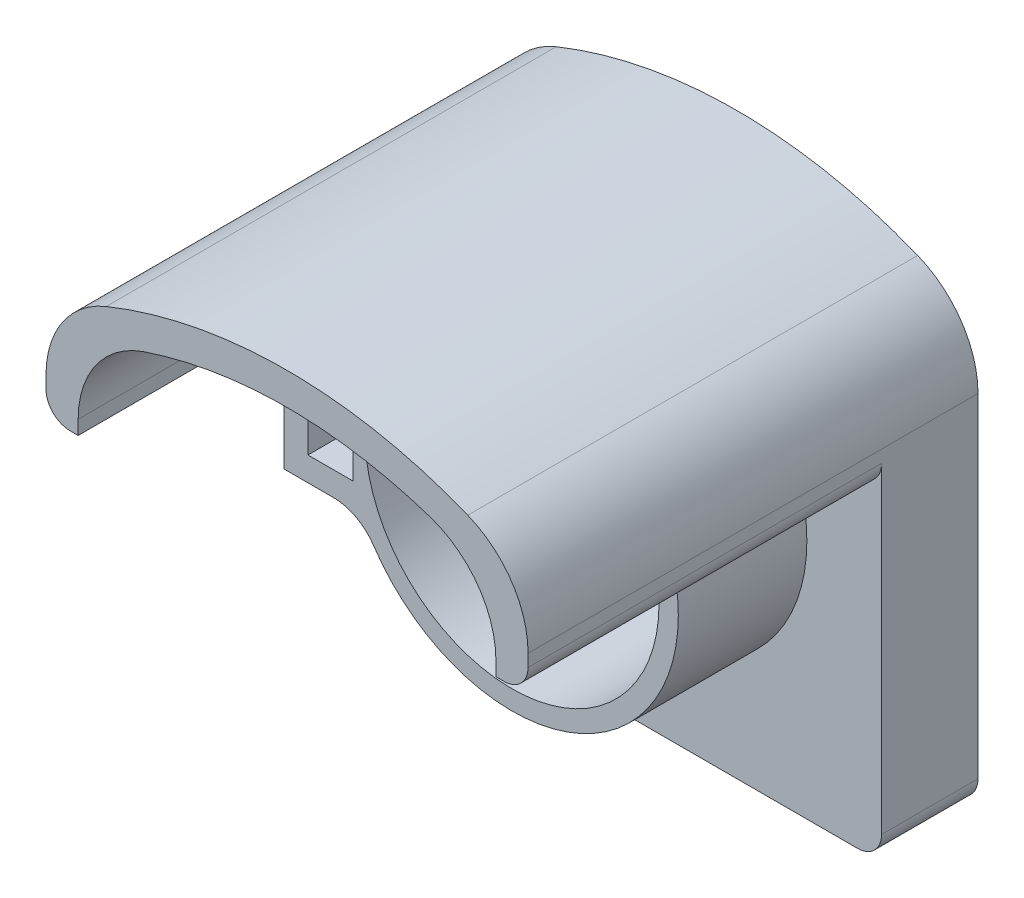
ISO-10303-21;
HEADER;
FILE_DESCRIPTION(('STEP AP214'),'2;1');
FILE_NAME('part.step','',(''),(''),'','','');
FILE_SCHEMA(('AUTOMOTIVE_DESIGN { 1 0 10303 214 1 1 1 1 }'));
ENDSEC;
DATA;
#1=APPLICATION_CONTEXT('core data for automotive mechanical design processes');
#2=APPLICATION_PROTOCOL_DEFINITION('international standard','automotive_design',2000,#1);
#3=PRODUCT_CONTEXT('',#1,'mechanical');
#4=PRODUCT('Part','Part','',(#3));
#5=PRODUCT_RELATED_PRODUCT_CATEGORY('part','',(#4));
#6=PRODUCT_DEFINITION_FORMATION('','',#4);
#7=PRODUCT_DEFINITION_CONTEXT('part definition',#1,'design');
#8=PRODUCT_DEFINITION('design','',#6,#7);
#9=PRODUCT_DEFINITION_SHAPE('','',#8);
#10=(LENGTH_UNIT() NAMED_UNIT(*) SI_UNIT(.MILLI.,.METRE.));
#11=(NAMED_UNIT(*) PLANE_ANGLE_UNIT() SI_UNIT($,.RADIAN.));
#12=(NAMED_UNIT(*) SI_UNIT($,.STERADIAN.) SOLID_ANGLE_UNIT());
#13=UNCERTAINTY_MEASURE_WITH_UNIT(LENGTH_MEASURE(1.E-05),#10,'distance_accuracy_value','');
#14=(GEOMETRIC_REPRESENTATION_CONTEXT(3) GLOBAL_UNCERTAINTY_ASSIGNED_CONTEXT((#13)) GLOBAL_UNIT_ASSIGNED_CONTEXT((#10,
#11,#12)) REPRESENTATION_CONTEXT('',''));
#15=CARTESIAN_POINT('',(0.,0.,0.));
#16=DIRECTION('',(0.,0.,1.));
#17=DIRECTION('',(1.,0.,0.));
#18=AXIS2_PLACEMENT_3D('',#15,#16,#17);
#19=CARTESIAN_POINT('',(0.,0.,6.));
#20=DIRECTION('',(0.,0.,-1.));
#21=DIRECTION('',(-1.,0.,0.));
#22=AXIS2_PLACEMENT_3D('',#19,#20,#21);
#23=PLANE('',#22);
#24=DIRECTION('',(1.,0.,0.));
#25=VECTOR('',#24,1.);
#26=CARTESIAN_POINT('',(-15.,-15.,6.));
#27=LINE('',#26,#25);
#28=CARTESIAN_POINT('',(-13.5,-15.,6.));
#29=VERTEX_POINT('',#28);
#30=CARTESIAN_POINT('',(13.5,-15.,6.));
#31=VERTEX_POINT('',#30);
#32=EDGE_CURVE('E409',#29,#31,#27,.T.);
#33=ORIENTED_EDGE('',*,*,#32,.T.);
#34=CARTESIAN_POINT('',(13.5,-13.5,6.));
#35=DIRECTION('',(0.,0.,-1.));
#36=DIRECTION('',(-1.,0.,0.));
#37=AXIS2_PLACEMENT_3D('',#34,#35,#36);
#38=CIRCLE('',#37,1.5);
#39=CARTESIAN_POINT('',(15.,-13.5,6.));
#40=VERTEX_POINT('',#39);
#41=EDGE_CURVE('E499',#31,#40,#38,.F.);
#42=ORIENTED_EDGE('',*,*,#41,.T.);
#43=DIRECTION('',(0.,1.,0.));
#44=VECTOR('',#43,1.);
#45=CARTESIAN_POINT('',(15.,-15.,6.));
#46=LINE('',#45,#44);
#47=CARTESIAN_POINT('',(15.,6.5,6.));
#48=VERTEX_POINT('',#47);
#49=EDGE_CURVE('E405',#40,#48,#46,.T.);
#50=ORIENTED_EDGE('',*,*,#49,.T.);
#51=CARTESIAN_POINT('',(13.5,6.5,6.));
#52=DIRECTION('',(0.,0.,-1.));
#53=DIRECTION('',(-1.,0.,0.));
#54=AXIS2_PLACEMENT_3D('',#51,#52,#53);
#55=CIRCLE('',#54,1.5);
#56=CARTESIAN_POINT('',(13.5,5.,6.));
#57=VERTEX_POINT('',#56);
#58=EDGE_CURVE('E521',#48,#57,#55,.T.);
#59=ORIENTED_EDGE('',*,*,#58,.T.);
#60=DIRECTION('',(-1.,0.,0.));
#61=VECTOR('',#60,1.);
#62=CARTESIAN_POINT('',(0.,4.99999999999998,6.));
#63=LINE('',#62,#61);
#64=CARTESIAN_POINT('',(13.,5.,6.));
#65=VERTEX_POINT('',#64);
#66=EDGE_CURVE('E378',#57,#65,#63,.T.);
#67=ORIENTED_EDGE('',*,*,#66,.T.);
#68=DIRECTION('',(0.,-1.,0.));
#69=VECTOR('',#68,1.);
#70=CARTESIAN_POINT('',(13.,0.,6.));
#71=LINE('',#70,#69);
#72=CARTESIAN_POINT('',(13.,5.87422830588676,6.));
#73=VERTEX_POINT('',#72);
#74=EDGE_CURVE('E393',#73,#65,#71,.T.);
#75=ORIENTED_EDGE('',*,*,#74,.F.);
#76=CARTESIAN_POINT('',(7.00000000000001,5.87422830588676,6.));
#77=DIRECTION('',(0.,0.,-1.));
#78=DIRECTION('',(-1.,0.,0.));
#79=AXIS2_PLACEMENT_3D('',#76,#77,#78);
#80=CIRCLE('',#79,6.);
#81=CARTESIAN_POINT('',(8.90764612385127,11.5628912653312,6.));
#82=VERTEX_POINT('',#81);
#83=EDGE_CURVE('E428',#73,#82,#80,.F.);
#84=ORIENTED_EDGE('',*,*,#83,.T.);
#85=CARTESIAN_POINT('',(0.,-15.,6.));
#86=DIRECTION('',(0.,0.,-1.));
#87=DIRECTION('',(-1.,0.,0.));
#88=AXIS2_PLACEMENT_3D('',#85,#86,#87);
#89=CIRCLE('',#88,28.0166620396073);
#90=CARTESIAN_POINT('',(-8.90764612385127,11.5628912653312,6.));
#91=VERTEX_POINT('',#90);
#92=EDGE_CURVE('E385',#91,#82,#89,.T.);
#93=ORIENTED_EDGE('',*,*,#92,.F.);
#94=CARTESIAN_POINT('',(-7.00000000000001,5.87422830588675,6.));
#95=DIRECTION('',(0.,0.,-1.));
#96=DIRECTION('',(-1.,0.,0.));
#97=AXIS2_PLACEMENT_3D('',#94,#95,#96);
#98=CIRCLE('',#97,6.);
#99=CARTESIAN_POINT('',(-13.,5.87422830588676,6.));
#100=VERTEX_POINT('',#99);
#101=EDGE_CURVE('E425',#91,#100,#98,.F.);
#102=ORIENTED_EDGE('',*,*,#101,.T.);
#103=DIRECTION('',(0.,1.,0.));
#104=VECTOR('',#103,1.);
#105=CARTESIAN_POINT('',(-13.,0.,6.));
#106=LINE('',#105,#104);
#107=CARTESIAN_POINT('',(-13.,5.,6.));
#108=VERTEX_POINT('',#107);
#109=EDGE_CURVE('E389',#108,#100,#106,.T.);
#110=ORIENTED_EDGE('',*,*,#109,.F.);
#111=DIRECTION('',(-1.,0.,0.));
#112=VECTOR('',#111,1.);
#113=CARTESIAN_POINT('',(0.,4.99999999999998,6.));
#114=LINE('',#113,#112);
#115=CARTESIAN_POINT('',(-13.5,5.,6.));
#116=VERTEX_POINT('',#115);
#117=EDGE_CURVE('E381',#108,#116,#114,.T.);
#118=ORIENTED_EDGE('',*,*,#117,.T.);
#119=CARTESIAN_POINT('',(-13.5,6.5,6.));
#120=DIRECTION('',(0.,0.,-1.));
#121=DIRECTION('',(-1.,0.,0.));
#122=AXIS2_PLACEMENT_3D('',#119,#120,#121);
#123=CIRCLE('',#122,1.5);
#124=CARTESIAN_POINT('',(-15.,6.5,6.));
#125=VERTEX_POINT('',#124);
#126=EDGE_CURVE('E524',#116,#125,#123,.T.);
#127=ORIENTED_EDGE('',*,*,#126,.T.);
#128=DIRECTION('',(0.,1.,0.));
#129=VECTOR('',#128,1.);
#130=CARTESIAN_POINT('',(-15.,-15.,6.));
#131=LINE('',#130,#129);
#132=CARTESIAN_POINT('',(-15.,-13.5,6.));
#133=VERTEX_POINT('',#132);
#134=EDGE_CURVE('E402',#133,#125,#131,.T.);
#135=ORIENTED_EDGE('',*,*,#134,.F.);
#136=CARTESIAN_POINT('',(-13.5,-13.5,6.));
#137=DIRECTION('',(0.,0.,-1.));
#138=DIRECTION('',(-1.,0.,0.));
#139=AXIS2_PLACEMENT_3D('',#136,#137,#138);
#140=CIRCLE('',#139,1.5);
#141=EDGE_CURVE('E496',#133,#29,#140,.F.);
#142=ORIENTED_EDGE('',*,*,#141,.T.);
#143=EDGE_LOOP('',(#33,#42,#50,#59,#67,#75,#84,#93,#102,#110,#118,#127,#135,#142));
#144=FACE_BOUND('',#143,.T.);
#145=CARTESIAN_POINT('',(0.,0.,6.));
#146=DIRECTION('',(0.,0.,1.));
#147=DIRECTION('',(1.,0.,0.));
#148=AXIS2_PLACEMENT_3D('',#145,#146,#147);
#149=CIRCLE('',#148,10.3499999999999);
#150=CARTESIAN_POINT('',(-8.61443141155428,-5.73707865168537,6.));
#151=VERTEX_POINT('',#150);
#152=CARTESIAN_POINT('',(-8.61443141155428,5.73707865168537,6.));
#153=VERTEX_POINT('',#152);
#154=EDGE_CURVE('E294',#151,#153,#149,.T.);
#155=ORIENTED_EDGE('',*,*,#154,.F.);
#156=CARTESIAN_POINT('',(-11.1113680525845,-7.4,6.));
#157=DIRECTION('',(0.,0.,-1.));
#158=DIRECTION('',(-1.,0.,0.));
#159=AXIS2_PLACEMENT_3D('',#156,#157,#158);
#160=CIRCLE('',#159,3.);
#161=CARTESIAN_POINT('',(-11.1113680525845,-4.4,6.));
#162=VERTEX_POINT('',#161);
#163=EDGE_CURVE('E544',#151,#162,#160,.F.);
#164=ORIENTED_EDGE('',*,*,#163,.T.);
#165=DIRECTION('',(-1.,0.,0.));
#166=VECTOR('',#165,1.);
#167=CARTESIAN_POINT('',(0.,-4.4,6.));
#168=LINE('',#167,#166);
#169=CARTESIAN_POINT('',(-14.2,-4.4,6.));
#170=VERTEX_POINT('',#169);
#171=EDGE_CURVE('E304',#162,#170,#168,.T.);
#172=ORIENTED_EDGE('',*,*,#171,.T.);
#173=DIRECTION('',(0.,-1.,0.));
#174=VECTOR('',#173,1.);
#175=CARTESIAN_POINT('',(-14.2,0.,6.));
#176=LINE('',#175,#174);
#177=CARTESIAN_POINT('',(-14.2,4.4,6.));
#178=VERTEX_POINT('',#177);
#179=EDGE_CURVE('E301',#178,#170,#176,.T.);
#180=ORIENTED_EDGE('',*,*,#179,.F.);
#181=DIRECTION('',(-1.,0.,0.));
#182=VECTOR('',#181,1.);
#183=CARTESIAN_POINT('',(0.,4.4,6.));
#184=LINE('',#183,#182);
#185=CARTESIAN_POINT('',(-11.1113680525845,4.4,6.));
#186=VERTEX_POINT('',#185);
#187=EDGE_CURVE('E258',#186,#178,#184,.T.);
#188=ORIENTED_EDGE('',*,*,#187,.F.);
#189=CARTESIAN_POINT('',(-11.1113680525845,7.4,6.));
#190=DIRECTION('',(0.,0.,-1.));
#191=DIRECTION('',(-1.,0.,0.));
#192=AXIS2_PLACEMENT_3D('',#189,#190,#191);
#193=CIRCLE('',#192,3.);
#194=EDGE_CURVE('E541',#186,#153,#193,.F.);
#195=ORIENTED_EDGE('',*,*,#194,.T.);
#196=EDGE_LOOP('',(#155,#164,#172,#180,#188,#195));
#197=FACE_BOUND('',#196,.T.);
#198=ADVANCED_FACE('F55',(#144,#197),#23,.F.);
#199=CARTESIAN_POINT('',(0.,0.,0.));
#200=DIRECTION('',(0.,0.,-1.));
#201=DIRECTION('',(-1.,0.,0.));
#202=AXIS2_PLACEMENT_3D('',#199,#200,#201);
#203=PLANE('',#202);
#204=CARTESIAN_POINT('',(10.,-10.,0.));
#205=DIRECTION('',(0.,0.,-1.));
#206=DIRECTION('',(-1.,0.,0.));
#207=AXIS2_PLACEMENT_3D('',#204,#205,#206);
#208=CIRCLE('',#207,2.34574082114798);
#209=CARTESIAN_POINT('',(7.65425917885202,-10.,0.));
#210=VERTEX_POINT('',#209);
#211=EDGE_CURVE('E566',#210,#210,#208,.T.);
#212=ORIENTED_EDGE('',*,*,#211,.F.);
#213=EDGE_LOOP('',(#212));
#214=FACE_BOUND('',#213,.T.);
#215=CARTESIAN_POINT('',(-10.,-10.,0.));
#216=DIRECTION('',(0.,0.,-1.));
#217=DIRECTION('',(-1.,0.,0.));
#218=AXIS2_PLACEMENT_3D('',#215,#216,#217);
#219=CIRCLE('',#218,2.34574082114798);
#220=CARTESIAN_POINT('',(-12.345740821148,-10.,0.));
#221=VERTEX_POINT('',#220);
#222=EDGE_CURVE('E562',#221,#221,#219,.F.);
#223=ORIENTED_EDGE('',*,*,#222,.T.);
#224=EDGE_LOOP('',(#223));
#225=FACE_BOUND('',#224,.T.);
#226=CARTESIAN_POINT('',(-10.,10.,0.));
#227=DIRECTION('',(0.,0.,-1.));
#228=DIRECTION('',(-1.,0.,0.));
#229=AXIS2_PLACEMENT_3D('',#226,#227,#228);
#230=CIRCLE('',#229,2.34574082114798);
#231=CARTESIAN_POINT('',(-12.345740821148,10.,0.));
#232=VERTEX_POINT('',#231);
#233=EDGE_CURVE('E558',#232,#232,#230,.F.);
#234=ORIENTED_EDGE('',*,*,#233,.T.);
#235=EDGE_LOOP('',(#234));
#236=FACE_BOUND('',#235,.T.);
#237=CARTESIAN_POINT('',(10.,10.,0.));
#238=DIRECTION('',(0.,0.,-1.));
#239=DIRECTION('',(-1.,0.,0.));
#240=AXIS2_PLACEMENT_3D('',#237,#238,#239);
#241=CIRCLE('',#240,2.34574082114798);
#242=CARTESIAN_POINT('',(7.65425917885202,10.,0.));
#243=VERTEX_POINT('',#242);
#244=EDGE_CURVE('E554',#243,#243,#241,.F.);
#245=ORIENTED_EDGE('',*,*,#244,.T.);
#246=EDGE_LOOP('',(#245));
#247=FACE_BOUND('',#246,.T.);
#248=CARTESIAN_POINT('',(0.,0.,0.));
#249=DIRECTION('',(0.,0.,1.));
#250=DIRECTION('',(1.,0.,0.));
#251=AXIS2_PLACEMENT_3D('',#248,#249,#250);
#252=CIRCLE('',#251,9.15);
#253=CARTESIAN_POINT('',(9.15,0.,0.));
#254=VERTEX_POINT('',#253);
#255=EDGE_CURVE('E397',#254,#254,#252,.T.);
#256=ORIENTED_EDGE('',*,*,#255,.T.);
#257=EDGE_LOOP('',(#256));
#258=FACE_BOUND('',#257,.T.);
#259=DIRECTION('',(0.,1.,0.));
#260=VECTOR('',#259,1.);
#261=CARTESIAN_POINT('',(15.,-15.,0.));
#262=LINE('',#261,#260);
#263=CARTESIAN_POINT('',(15.,-13.5,0.));
#264=VERTEX_POINT('',#263);
#265=CARTESIAN_POINT('',(15.,7.26656811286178,0.));
#266=VERTEX_POINT('',#265);
#267=EDGE_CURVE('E416',#264,#266,#262,.T.);
#268=ORIENTED_EDGE('',*,*,#267,.F.);
#269=CARTESIAN_POINT('',(13.5,-13.5,0.));
#270=DIRECTION('',(0.,0.,-1.));
#271=DIRECTION('',(-1.,0.,0.));
#272=AXIS2_PLACEMENT_3D('',#269,#270,#271);
#273=CIRCLE('',#272,1.5);
#274=CARTESIAN_POINT('',(13.5,-15.,0.));
#275=VERTEX_POINT('',#274);
#276=EDGE_CURVE('E486',#264,#275,#273,.T.);
#277=ORIENTED_EDGE('',*,*,#276,.T.);
#278=DIRECTION('',(1.,0.,0.));
#279=VECTOR('',#278,1.);
#280=CARTESIAN_POINT('',(-15.,-15.,0.));
#281=LINE('',#280,#279);
#282=CARTESIAN_POINT('',(-13.5,-15.,0.));
#283=VERTEX_POINT('',#282);
#284=EDGE_CURVE('E406',#283,#275,#281,.T.);
#285=ORIENTED_EDGE('',*,*,#284,.F.);
#286=CARTESIAN_POINT('',(-13.5,-13.5,0.));
#287=DIRECTION('',(0.,0.,-1.));
#288=DIRECTION('',(-1.,0.,0.));
#289=AXIS2_PLACEMENT_3D('',#286,#287,#288);
#290=CIRCLE('',#289,1.5);
#291=CARTESIAN_POINT('',(-15.,-13.5,0.));
#292=VERTEX_POINT('',#291);
#293=EDGE_CURVE('E483',#283,#292,#290,.T.);
#294=ORIENTED_EDGE('',*,*,#293,.T.);
#295=DIRECTION('',(0.,1.,0.));
#296=VECTOR('',#295,1.);
#297=CARTESIAN_POINT('',(-15.,-15.,0.));
#298=LINE('',#297,#296);
#299=CARTESIAN_POINT('',(-15.,7.26656811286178,0.));
#300=VERTEX_POINT('',#299);
#301=EDGE_CURVE('E401',#292,#300,#298,.T.);
#302=ORIENTED_EDGE('',*,*,#301,.T.);
#303=CARTESIAN_POINT('',(-9.,7.26656811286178,0.));
#304=DIRECTION('',(0.,0.,-1.));
#305=DIRECTION('',(-1.,0.,0.));
#306=AXIS2_PLACEMENT_3D('',#303,#304,#305);
#307=CIRCLE('',#306,6.);
#308=CARTESIAN_POINT('',(-11.2484390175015,12.829348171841,0.));
#309=VERTEX_POINT('',#308);
#310=EDGE_CURVE('E449',#300,#309,#307,.T.);
#311=ORIENTED_EDGE('',*,*,#310,.T.);
#312=CARTESIAN_POINT('',(0.,-15.,0.));
#313=DIRECTION('',(0.,0.,-1.));
#314=DIRECTION('',(-1.,0.,0.));
#315=AXIS2_PLACEMENT_3D('',#312,#313,#314);
#316=CIRCLE('',#315,30.0166620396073);
#317=CARTESIAN_POINT('',(11.2484390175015,12.829348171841,0.));
#318=VERTEX_POINT('',#317);
#319=EDGE_CURVE('E334',#309,#318,#316,.T.);
#320=ORIENTED_EDGE('',*,*,#319,.T.);
#321=CARTESIAN_POINT('',(9.,7.26656811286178,0.));
#322=DIRECTION('',(0.,0.,-1.));
#323=DIRECTION('',(-1.,0.,0.));
#324=AXIS2_PLACEMENT_3D('',#321,#322,#323);
#325=CIRCLE('',#324,6.);
#326=EDGE_CURVE('E445',#318,#266,#325,.T.);
#327=ORIENTED_EDGE('',*,*,#326,.T.);
#328=EDGE_LOOP('',(#268,#277,#285,#294,#302,#311,#320,#327));
#329=FACE_BOUND('',#328,.T.);
#330=ADVANCED_FACE('F614',(#214,#225,#236,#247,#258,#329),#203,.T.);
#331=CARTESIAN_POINT('',(-15.,-15.,6.));
#332=DIRECTION('',(-1.,0.,0.));
#333=DIRECTION('',(0.,0.,1.));
#334=AXIS2_PLACEMENT_3D('',#331,#332,#333);
#335=PLANE('',#334);
#336=ORIENTED_EDGE('',*,*,#301,.F.);
#337=DIRECTION('',(0.,0.,-1.));
#338=VECTOR('',#337,1.);
#339=CARTESIAN_POINT('',(-15.,-13.5,6.));
#340=LINE('',#339,#338);
#341=EDGE_CURVE('E505',#292,#133,#340,.F.);
#342=ORIENTED_EDGE('',*,*,#341,.T.);
#343=ORIENTED_EDGE('',*,*,#134,.T.);
#344=DIRECTION('',(0.,0.,-1.));
#345=VECTOR('',#344,1.);
#346=CARTESIAN_POINT('',(-15.,6.5,6.));
#347=LINE('',#346,#345);
#348=CARTESIAN_POINT('',(-15.,6.5,28.));
#349=VERTEX_POINT('',#348);
#350=EDGE_CURVE('E502',#125,#349,#347,.F.);
#351=ORIENTED_EDGE('',*,*,#350,.T.);
#352=DIRECTION('',(0.,1.,0.));
#353=VECTOR('',#352,1.);
#354=CARTESIAN_POINT('',(-15.,11.,28.));
#355=LINE('',#354,#353);
#356=CARTESIAN_POINT('',(-15.,7.26656811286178,28.));
#357=VERTEX_POINT('',#356);
#358=EDGE_CURVE('E352',#349,#357,#355,.T.);
#359=ORIENTED_EDGE('',*,*,#358,.T.);
#360=DIRECTION('',(0.,0.,-1.));
#361=VECTOR('',#360,1.);
#362=CARTESIAN_POINT('',(-15.,7.26656811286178,6.));
#363=LINE('',#362,#361);
#364=EDGE_CURVE('E441',#357,#300,#363,.T.);
#365=ORIENTED_EDGE('',*,*,#364,.T.);
#366=EDGE_LOOP('',(#336,#342,#343,#351,#359,#365));
#367=FACE_BOUND('',#366,.T.);
#368=ADVANCED_FACE('F617',(#367),#335,.T.);
#369=CARTESIAN_POINT('',(-15.,-15.,6.));
#370=DIRECTION('',(0.,1.,0.));
#371=DIRECTION('',(-1.,0.,0.));
#372=AXIS2_PLACEMENT_3D('',#369,#370,#371);
#373=PLANE('',#372);
#374=ORIENTED_EDGE('',*,*,#284,.T.);
#375=DIRECTION('',(0.,0.,-1.));
#376=VECTOR('',#375,1.);
#377=CARTESIAN_POINT('',(13.5,-15.,6.));
#378=LINE('',#377,#376);
#379=EDGE_CURVE('E493',#275,#31,#378,.F.);
#380=ORIENTED_EDGE('',*,*,#379,.T.);
#381=ORIENTED_EDGE('',*,*,#32,.F.);
#382=DIRECTION('',(0.,0.,-1.));
#383=VECTOR('',#382,1.);
#384=CARTESIAN_POINT('',(-13.5,-15.,0.));
#385=LINE('',#384,#383);
#386=EDGE_CURVE('E489',#29,#283,#385,.T.);
#387=ORIENTED_EDGE('',*,*,#386,.T.);
#388=EDGE_LOOP('',(#374,#380,#381,#387));
#389=FACE_BOUND('',#388,.T.);
#390=ADVANCED_FACE('F636',(#389),#373,.F.);
#391=CARTESIAN_POINT('',(15.,-15.,6.));
#392=DIRECTION('',(-1.,0.,0.));
#393=DIRECTION('',(0.,-1.,0.));
#394=AXIS2_PLACEMENT_3D('',#391,#392,#393);
#395=PLANE('',#394);
#396=ORIENTED_EDGE('',*,*,#49,.F.);
#397=DIRECTION('',(0.,0.,-1.));
#398=VECTOR('',#397,1.);
#399=CARTESIAN_POINT('',(15.,-13.5,6.));
#400=LINE('',#399,#398);
#401=EDGE_CURVE('E479',#40,#264,#400,.T.);
#402=ORIENTED_EDGE('',*,*,#401,.T.);
#403=ORIENTED_EDGE('',*,*,#267,.T.);
#404=DIRECTION('',(0.,0.,1.));
#405=VECTOR('',#404,1.);
#406=CARTESIAN_POINT('',(15.,7.26656811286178,28.));
#407=LINE('',#406,#405);
#408=CARTESIAN_POINT('',(15.,7.26656811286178,28.));
#409=VERTEX_POINT('',#408);
#410=EDGE_CURVE('E466',#266,#409,#407,.T.);
#411=ORIENTED_EDGE('',*,*,#410,.T.);
#412=DIRECTION('',(0.,-1.,0.));
#413=VECTOR('',#412,1.);
#414=CARTESIAN_POINT('',(15.,11.,28.));
#415=LINE('',#414,#413);
#416=CARTESIAN_POINT('',(15.,6.5,28.));
#417=VERTEX_POINT('',#416);
#418=EDGE_CURVE('E344',#409,#417,#415,.T.);
#419=ORIENTED_EDGE('',*,*,#418,.T.);
#420=DIRECTION('',(0.,0.,-1.));
#421=VECTOR('',#420,1.);
#422=CARTESIAN_POINT('',(15.,6.5,6.));
#423=LINE('',#422,#421);
#424=EDGE_CURVE('E475',#417,#48,#423,.T.);
#425=ORIENTED_EDGE('',*,*,#424,.T.);
#426=EDGE_LOOP('',(#396,#402,#403,#411,#419,#425));
#427=FACE_BOUND('',#426,.T.);
#428=ADVANCED_FACE('F627',(#427),#395,.F.);
#429=CARTESIAN_POINT('',(0.,0.,6.));
#430=DIRECTION('',(0.,0.,-1.));
#431=DIRECTION('',(-1.,0.,0.));
#432=AXIS2_PLACEMENT_3D('',#429,#430,#431);
#433=CYLINDRICAL_SURFACE('',#432,9.15);
#434=CARTESIAN_POINT('',(-9.15,0.,11.5));
#435=CARTESIAN_POINT('',(-9.1499985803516,-0.0836545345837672,11.4999966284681));
#436=CARTESIAN_POINT('',(-9.14884081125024,-0.167355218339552,11.4929782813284));
#437=CARTESIAN_POINT('',(-9.14433371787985,-0.332410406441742,11.4651012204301));
#438=CARTESIAN_POINT('',(-9.14098235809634,-0.413762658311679,11.4442296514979));
#439=CARTESIAN_POINT('',(-9.13246410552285,-0.571708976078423,11.3892921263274));
#440=CARTESIAN_POINT('',(-9.1272986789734,-0.648306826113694,11.3552368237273));
#441=CARTESIAN_POINT('',(-9.1157207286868,-0.79469105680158,11.2749261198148));
#442=CARTESIAN_POINT('',(-9.1093083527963,-0.864478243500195,11.2286721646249));
#443=CARTESIAN_POINT('',(-9.09588132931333,-0.995916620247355,11.1248212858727));
#444=CARTESIAN_POINT('',(-9.08886213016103,-1.05749557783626,11.0671335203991));
#445=CARTESIAN_POINT('',(-9.07504753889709,-1.17014567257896,10.9422480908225));
#446=CARTESIAN_POINT('',(-9.06825216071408,-1.22121615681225,10.8750498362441));
#447=CARTESIAN_POINT('',(-9.05561051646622,-1.31168767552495,10.7325565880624));
#448=CARTESIAN_POINT('',(-9.04977013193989,-1.351017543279,10.6572158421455));
#449=CARTESIAN_POINT('',(-9.03976272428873,-1.41643635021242,10.5008855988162));
#450=CARTESIAN_POINT('',(-9.03559559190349,-1.44252615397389,10.4198964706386));
#451=CARTESIAN_POINT('',(-9.02945172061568,-1.48049720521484,10.2553331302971));
#452=CARTESIAN_POINT('',(-9.02745579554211,-1.49250298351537,10.1717883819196));
#453=CARTESIAN_POINT('',(-9.02582225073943,-1.50235123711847,10.0038481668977));
#454=CARTESIAN_POINT('',(-9.02618446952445,-1.50019468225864,9.91945275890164));
#455=CARTESIAN_POINT('',(-9.029208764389,-1.48188097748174,9.7530942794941));
#456=CARTESIAN_POINT('',(-9.03184789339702,-1.46586351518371,9.67111535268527));
#457=CARTESIAN_POINT('',(-9.0390927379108,-1.42050179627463,9.51102445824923));
#458=CARTESIAN_POINT('',(-9.04369851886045,-1.39115709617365,9.43291261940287));
#459=CARTESIAN_POINT('',(-9.05438259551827,-1.31983164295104,9.28235386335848));
#460=CARTESIAN_POINT('',(-9.06046764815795,-1.27779268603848,9.20993501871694));
#461=CARTESIAN_POINT('',(-9.07341991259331,-1.18231339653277,9.0731264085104));
#462=CARTESIAN_POINT('',(-9.08028718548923,-1.12887217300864,9.00873727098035));
#463=CARTESIAN_POINT('',(-9.09413104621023,-1.01134329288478,8.88900709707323));
#464=CARTESIAN_POINT('',(-9.10110795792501,-0.947135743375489,8.83378371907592));
#465=CARTESIAN_POINT('',(-9.1143088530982,-0.810302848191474,8.73487722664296));
#466=CARTESIAN_POINT('',(-9.1205328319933,-0.737677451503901,8.69119418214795));
#467=CARTESIAN_POINT('',(-9.13153500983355,-0.58596127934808,8.61659844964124));
#468=CARTESIAN_POINT('',(-9.1363120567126,-0.506865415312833,8.58569593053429));
#469=CARTESIAN_POINT('',(-9.14387281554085,-0.344510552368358,8.53764646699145));
#470=CARTESIAN_POINT('',(-9.14665668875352,-0.261251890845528,8.52049840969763));
#471=CARTESIAN_POINT('',(-9.149895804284,-0.0939491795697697,8.50060361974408));
#472=CARTESIAN_POINT('',(-9.15037716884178,-0.00992482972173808,8.49769532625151));
#473=CARTESIAN_POINT('',(-9.1490285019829,0.157410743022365,8.50593221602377));
#474=CARTESIAN_POINT('',(-9.14719855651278,0.240721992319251,8.51707687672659));
#475=CARTESIAN_POINT('',(-9.14144905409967,0.403769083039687,8.55296894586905));
#476=CARTESIAN_POINT('',(-9.13754175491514,0.483522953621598,8.57763658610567));
#477=CARTESIAN_POINT('',(-9.12807396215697,0.63776312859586,8.63978951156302));
#478=CARTESIAN_POINT('',(-9.12251337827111,0.71224914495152,8.67727549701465));
#479=CARTESIAN_POINT('',(-9.11029124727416,0.854542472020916,8.76437258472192));
#480=CARTESIAN_POINT('',(-9.10362067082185,0.922287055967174,8.81408487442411));
#481=CARTESIAN_POINT('',(-9.08994633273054,1.04852995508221,8.92408394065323));
#482=CARTESIAN_POINT('',(-9.08294254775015,1.10702762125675,8.98437145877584));
#483=CARTESIAN_POINT('',(-9.06930697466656,1.21371314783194,9.11453333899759));
#484=CARTESIAN_POINT('',(-9.06267960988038,1.26179199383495,9.18449758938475));
#485=CARTESIAN_POINT('',(-9.05062913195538,1.34551436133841,9.33160431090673));
#486=CARTESIAN_POINT('',(-9.04520598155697,1.38115826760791,9.40874655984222));
#487=CARTESIAN_POINT('',(-9.03621095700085,1.43883489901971,9.56771122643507));
#488=CARTESIAN_POINT('',(-9.03263164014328,1.46092241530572,9.64951332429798));
#489=CARTESIAN_POINT('',(-9.0277106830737,1.49103205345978,9.81572989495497));
#490=CARTESIAN_POINT('',(-9.02636885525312,1.4990553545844,9.90014414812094));
#491=CARTESIAN_POINT('',(-9.02608270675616,1.50077674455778,10.0681005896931));
#492=CARTESIAN_POINT('',(-9.02710967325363,1.49464639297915,10.1516410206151));
#493=CARTESIAN_POINT('',(-9.03138256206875,1.46860489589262,10.3164848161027));
#494=CARTESIAN_POINT('',(-9.0346284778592,1.44869379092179,10.3977881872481));
#495=CARTESIAN_POINT('',(-9.04296276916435,1.39572086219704,10.5557868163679));
#496=CARTESIAN_POINT('',(-9.04804914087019,1.36267333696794,10.6324869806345));
#497=CARTESIAN_POINT('',(-9.05949325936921,1.28438318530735,10.7792820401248));
#498=CARTESIAN_POINT('',(-9.06585106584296,1.23913998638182,10.8493766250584));
#499=CARTESIAN_POINT('',(-9.0792129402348,1.13712859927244,10.9818384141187));
#500=CARTESIAN_POINT('',(-9.08622359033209,1.08023404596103,11.0441076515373));
#501=CARTESIAN_POINT('',(-9.10004831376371,0.956801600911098,11.1582741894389));
#502=CARTESIAN_POINT('',(-9.10686234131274,0.890261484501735,11.2101690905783));
#503=CARTESIAN_POINT('',(-9.11957853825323,0.748900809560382,11.302428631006));
#504=CARTESIAN_POINT('',(-9.12547433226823,0.674028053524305,11.3427141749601));
#505=CARTESIAN_POINT('',(-9.13562767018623,0.518512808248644,11.4100746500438));
#506=CARTESIAN_POINT('',(-9.139886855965,0.437876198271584,11.4371628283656));
#507=CARTESIAN_POINT('',(-9.14535028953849,0.297431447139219,11.4714345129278));
#508=CARTESIAN_POINT('',(-9.1470846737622,0.23847601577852,11.4821295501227));
#509=CARTESIAN_POINT('',(-9.14941002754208,0.119688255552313,11.4964134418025));
#510=CARTESIAN_POINT('',(-9.15000101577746,0.059855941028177,11.5000024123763));
#511=CARTESIAN_POINT('',(-9.15,0.,11.5));
#512=B_SPLINE_CURVE_WITH_KNOTS('',3,(#434,#435,#436,#437,#438,#439,#440,#441,#442,#443,#444,
#445,#446,#447,#448,#449,#450,#451,#452,#453,#454,#455,#456,#457,#458,#459,#460,#461,#462,#463,
#464,#465,#466,#467,#468,#469,#470,#471,#472,#473,#474,#475,#476,#477,#478,#479,#480,#481,#482,
#483,#484,#485,#486,#487,#488,#489,#490,#491,#492,#493,#494,#495,#496,#497,#498,#499,#500,#501,
#502,#503,#504,#505,#506,#507,#508,#509,#510,#511),.UNSPECIFIED.,.T.,.F.,(4,2,2,2,2,2,2,2,2,2,2,
2,2,2,2,2,2,2,2,2,2,2,2,2,2,2,2,2,2,2,2,2,2,2,2,2,2,2,4),(0.,0.250744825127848,0.50172265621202,
0.752498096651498,1.00324382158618,1.2560679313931,1.50890774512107,1.76325042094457,
2.01757648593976,2.26963643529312,2.52167912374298,2.77121096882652,3.02075111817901,
3.27145325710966,3.52217499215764,3.77590087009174,4.02962828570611,4.28355719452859,
4.53746555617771,4.78848635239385,5.03949781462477,5.28904431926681,5.53860445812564,
5.79030394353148,6.04202108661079,6.29625686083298,6.55048476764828,6.80367827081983,
7.05685054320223,7.30697019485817,7.55708911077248,7.80693652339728,8.05679566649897,
8.30952368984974,8.56231009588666,8.81678009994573,9.07099414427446,9.25040835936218,
9.42981964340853),.UNSPECIFIED.);
#513=CARTESIAN_POINT('',(-9.15,0.,11.5));
#514=VERTEX_POINT('',#513);
#515=EDGE_CURVE('E298',#514,#514,#512,.T.);
#516=ORIENTED_EDGE('',*,*,#515,.F.);
#517=EDGE_LOOP('',(#516));
#518=FACE_BOUND('',#517,.T.);
#519=ORIENTED_EDGE('',*,*,#255,.F.);
#520=EDGE_LOOP('',(#519));
#521=FACE_BOUND('',#520,.T.);
#522=CARTESIAN_POINT('',(0.,0.,14.));
#523=DIRECTION('',(0.,0.,1.));
#524=DIRECTION('',(1.,0.,0.));
#525=AXIS2_PLACEMENT_3D('',#522,#523,#524);
#526=CIRCLE('',#525,9.15);
#527=CARTESIAN_POINT('',(9.15,0.,14.));
#528=VERTEX_POINT('',#527);
#529=EDGE_CURVE('E290',#528,#528,#526,.F.);
#530=ORIENTED_EDGE('',*,*,#529,.F.);
#531=EDGE_LOOP('',(#530));
#532=FACE_BOUND('',#531,.T.);
#533=ADVANCED_FACE('F751',(#518,#521,#532),#433,.F.);
#534=CARTESIAN_POINT('',(13.,11.,28.));
#535=DIRECTION('',(1.,0.,0.));
#536=DIRECTION('',(0.,1.,0.));
#537=AXIS2_PLACEMENT_3D('',#534,#535,#536);
#538=PLANE('',#537);
#539=DIRECTION('',(0.,-1.,0.));
#540=VECTOR('',#539,1.);
#541=CARTESIAN_POINT('',(13.,11.,28.));
#542=LINE('',#541,#540);
#543=CARTESIAN_POINT('',(13.,5.87422830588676,28.));
#544=VERTEX_POINT('',#543);
#545=CARTESIAN_POINT('',(13.,5.,28.));
#546=VERTEX_POINT('',#545);
#547=EDGE_CURVE('E337',#544,#546,#542,.T.);
#548=ORIENTED_EDGE('',*,*,#547,.F.);
#549=DIRECTION('',(0.,0.,1.));
#550=VECTOR('',#549,1.);
#551=CARTESIAN_POINT('',(13.,5.87422830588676,6.));
#552=LINE('',#551,#550);
#553=EDGE_CURVE('E413',#544,#73,#552,.F.);
#554=ORIENTED_EDGE('',*,*,#553,.T.);
#555=ORIENTED_EDGE('',*,*,#74,.T.);
#556=DIRECTION('',(0.,0.,-1.));
#557=VECTOR('',#556,1.);
#558=CARTESIAN_POINT('',(13.,5.,28.));
#559=LINE('',#558,#557);
#560=EDGE_CURVE('E374',#546,#65,#559,.T.);
#561=ORIENTED_EDGE('',*,*,#560,.F.);
#562=EDGE_LOOP('',(#548,#554,#555,#561));
#563=FACE_BOUND('',#562,.T.);
#564=ADVANCED_FACE('F678',(#563),#538,.F.);
#565=CARTESIAN_POINT('',(-13.,11.,28.));
#566=DIRECTION('',(-1.,0.,0.));
#567=DIRECTION('',(0.,-1.,0.));
#568=AXIS2_PLACEMENT_3D('',#565,#566,#567);
#569=PLANE('',#568);
#570=ORIENTED_EDGE('',*,*,#109,.T.);
#571=DIRECTION('',(0.,0.,1.));
#572=VECTOR('',#571,1.);
#573=CARTESIAN_POINT('',(-13.,5.87422830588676,28.));
#574=LINE('',#573,#572);
#575=CARTESIAN_POINT('',(-13.,5.87422830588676,28.));
#576=VERTEX_POINT('',#575);
#577=EDGE_CURVE('E438',#100,#576,#574,.T.);
#578=ORIENTED_EDGE('',*,*,#577,.T.);
#579=DIRECTION('',(0.,1.,0.));
#580=VECTOR('',#579,1.);
#581=CARTESIAN_POINT('',(-13.,11.,28.));
#582=LINE('',#581,#580);
#583=CARTESIAN_POINT('',(-13.,5.,28.));
#584=VERTEX_POINT('',#583);
#585=EDGE_CURVE('E359',#584,#576,#582,.T.);
#586=ORIENTED_EDGE('',*,*,#585,.F.);
#587=DIRECTION('',(0.,0.,-1.));
#588=VECTOR('',#587,1.);
#589=CARTESIAN_POINT('',(-13.,5.,28.));
#590=LINE('',#589,#588);
#591=EDGE_CURVE('E367',#584,#108,#590,.T.);
#592=ORIENTED_EDGE('',*,*,#591,.T.);
#593=EDGE_LOOP('',(#570,#578,#586,#592));
#594=FACE_BOUND('',#593,.T.);
#595=ADVANCED_FACE('F695',(#594),#569,.F.);
#596=CARTESIAN_POINT('',(0.,-15.,28.));
#597=DIRECTION('',(0.,0.,-1.));
#598=DIRECTION('',(-1.,0.,0.));
#599=AXIS2_PLACEMENT_3D('',#596,#597,#598);
#600=CYLINDRICAL_SURFACE('',#599,28.0166620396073);
#601=ORIENTED_EDGE('',*,*,#92,.T.);
#602=DIRECTION('',(0.,0.,-1.));
#603=VECTOR('',#602,1.);
#604=CARTESIAN_POINT('',(8.90764612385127,11.5628912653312,28.));
#605=LINE('',#604,#603);
#606=CARTESIAN_POINT('',(8.90764612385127,11.5628912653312,28.));
#607=VERTEX_POINT('',#606);
#608=EDGE_CURVE('E435',#82,#607,#605,.F.);
#609=ORIENTED_EDGE('',*,*,#608,.T.);
#610=CARTESIAN_POINT('',(0.,-15.,28.));
#611=DIRECTION('',(0.,0.,1.));
#612=DIRECTION('',(1.,0.,0.));
#613=AXIS2_PLACEMENT_3D('',#610,#611,#612);
#614=CIRCLE('',#613,28.0166620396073);
#615=CARTESIAN_POINT('',(-8.90764612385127,11.5628912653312,28.));
#616=VERTEX_POINT('',#615);
#617=EDGE_CURVE('E363',#616,#607,#614,.F.);
#618=ORIENTED_EDGE('',*,*,#617,.F.);
#619=DIRECTION('',(0.,0.,-1.));
#620=VECTOR('',#619,1.);
#621=CARTESIAN_POINT('',(-8.90764612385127,11.5628912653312,28.));
#622=LINE('',#621,#620);
#623=EDGE_CURVE('E431',#616,#91,#622,.T.);
#624=ORIENTED_EDGE('',*,*,#623,.T.);
#625=EDGE_LOOP('',(#601,#609,#618,#624));
#626=FACE_BOUND('',#625,.T.);
#627=ADVANCED_FACE('F684',(#626),#600,.F.);
#628=CARTESIAN_POINT('',(-13.,5.,28.));
#629=DIRECTION('',(0.,-1.,0.));
#630=DIRECTION('',(1.,0.,0.));
#631=AXIS2_PLACEMENT_3D('',#628,#629,#630);
#632=PLANE('',#631);
#633=DIRECTION('',(-1.,0.,0.));
#634=VECTOR('',#633,1.);
#635=CARTESIAN_POINT('',(-13.,5.,28.));
#636=LINE('',#635,#634);
#637=CARTESIAN_POINT('',(-13.5,5.,28.));
#638=VERTEX_POINT('',#637);
#639=EDGE_CURVE('E355',#584,#638,#636,.T.);
#640=ORIENTED_EDGE('',*,*,#639,.T.);
#641=DIRECTION('',(0.,0.,-1.));
#642=VECTOR('',#641,1.);
#643=CARTESIAN_POINT('',(-13.5,5.,28.));
#644=LINE('',#643,#642);
#645=EDGE_CURVE('E517',#638,#116,#644,.T.);
#646=ORIENTED_EDGE('',*,*,#645,.T.);
#647=ORIENTED_EDGE('',*,*,#117,.F.);
#648=ORIENTED_EDGE('',*,*,#591,.F.);
#649=EDGE_LOOP('',(#640,#646,#647,#648));
#650=FACE_BOUND('',#649,.T.);
#651=ADVANCED_FACE('F699',(#650),#632,.T.);
#652=CARTESIAN_POINT('',(15.,5.,28.));
#653=DIRECTION('',(0.,-1.,0.));
#654=DIRECTION('',(1.,0.,0.));
#655=AXIS2_PLACEMENT_3D('',#652,#653,#654);
#656=PLANE('',#655);
#657=ORIENTED_EDGE('',*,*,#66,.F.);
#658=DIRECTION('',(0.,0.,-1.));
#659=VECTOR('',#658,1.);
#660=CARTESIAN_POINT('',(13.5,5.,28.));
#661=LINE('',#660,#659);
#662=CARTESIAN_POINT('',(13.5,5.,28.));
#663=VERTEX_POINT('',#662);
#664=EDGE_CURVE('E508',#57,#663,#661,.F.);
#665=ORIENTED_EDGE('',*,*,#664,.T.);
#666=DIRECTION('',(-1.,0.,0.));
#667=VECTOR('',#666,1.);
#668=CARTESIAN_POINT('',(15.,5.,28.));
#669=LINE('',#668,#667);
#670=EDGE_CURVE('E341',#663,#546,#669,.T.);
#671=ORIENTED_EDGE('',*,*,#670,.T.);
#672=ORIENTED_EDGE('',*,*,#560,.T.);
#673=EDGE_LOOP('',(#657,#665,#671,#672));
#674=FACE_BOUND('',#673,.T.);
#675=ADVANCED_FACE('F674',(#674),#656,.T.);
#676=CARTESIAN_POINT('',(0.,-15.,28.));
#677=DIRECTION('',(0.,0.,-1.));
#678=DIRECTION('',(-1.,0.,0.));
#679=AXIS2_PLACEMENT_3D('',#676,#677,#678);
#680=CYLINDRICAL_SURFACE('',#679,30.0166620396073);
#681=ORIENTED_EDGE('',*,*,#319,.F.);
#682=DIRECTION('',(0.,0.,-1.));
#683=VECTOR('',#682,1.);
#684=CARTESIAN_POINT('',(-11.2484390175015,12.829348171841,28.));
#685=LINE('',#684,#683);
#686=CARTESIAN_POINT('',(-11.2484390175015,12.829348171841,28.));
#687=VERTEX_POINT('',#686);
#688=EDGE_CURVE('E456',#309,#687,#685,.F.);
#689=ORIENTED_EDGE('',*,*,#688,.T.);
#690=CARTESIAN_POINT('',(0.,-15.,28.));
#691=DIRECTION('',(0.,0.,-1.));
#692=DIRECTION('',(-1.,0.,0.));
#693=AXIS2_PLACEMENT_3D('',#690,#691,#692);
#694=CIRCLE('',#693,30.0166620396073);
#695=CARTESIAN_POINT('',(11.2484390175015,12.829348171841,28.));
#696=VERTEX_POINT('',#695);
#697=EDGE_CURVE('E348',#687,#696,#694,.T.);
#698=ORIENTED_EDGE('',*,*,#697,.T.);
#699=DIRECTION('',(0.,0.,-1.));
#700=VECTOR('',#699,1.);
#701=CARTESIAN_POINT('',(11.2484390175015,12.829348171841,28.));
#702=LINE('',#701,#700);
#703=EDGE_CURVE('E452',#696,#318,#702,.T.);
#704=ORIENTED_EDGE('',*,*,#703,.T.);
#705=EDGE_LOOP('',(#681,#689,#698,#704));
#706=FACE_BOUND('',#705,.T.);
#707=ADVANCED_FACE('F656',(#706),#680,.T.);
#708=CARTESIAN_POINT('',(0.,-15.,28.));
#709=DIRECTION('',(0.,0.,-1.));
#710=DIRECTION('',(-1.,0.,0.));
#711=AXIS2_PLACEMENT_3D('',#708,#709,#710);
#712=PLANE('',#711);
#713=ORIENTED_EDGE('',*,*,#670,.F.);
#714=CARTESIAN_POINT('',(13.5,6.5,28.));
#715=DIRECTION('',(0.,0.,-1.));
#716=DIRECTION('',(-1.,0.,0.));
#717=AXIS2_PLACEMENT_3D('',#714,#715,#716);
#718=CIRCLE('',#717,1.5);
#719=EDGE_CURVE('E514',#663,#417,#718,.F.);
#720=ORIENTED_EDGE('',*,*,#719,.T.);
#721=ORIENTED_EDGE('',*,*,#418,.F.);
#722=CARTESIAN_POINT('',(9.,7.26656811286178,28.));
#723=DIRECTION('',(0.,0.,-1.));
#724=DIRECTION('',(-1.,0.,0.));
#725=AXIS2_PLACEMENT_3D('',#722,#723,#724);
#726=CIRCLE('',#725,6.);
#727=EDGE_CURVE('E459',#409,#696,#726,.F.);
#728=ORIENTED_EDGE('',*,*,#727,.T.);
#729=ORIENTED_EDGE('',*,*,#697,.F.);
#730=CARTESIAN_POINT('',(-9.,7.26656811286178,28.));
#731=DIRECTION('',(0.,0.,-1.));
#732=DIRECTION('',(-1.,0.,0.));
#733=AXIS2_PLACEMENT_3D('',#730,#731,#732);
#734=CIRCLE('',#733,6.);
#735=EDGE_CURVE('E462',#687,#357,#734,.F.);
#736=ORIENTED_EDGE('',*,*,#735,.T.);
#737=ORIENTED_EDGE('',*,*,#358,.F.);
#738=CARTESIAN_POINT('',(-13.5,6.5,28.));
#739=DIRECTION('',(0.,0.,-1.));
#740=DIRECTION('',(-1.,0.,0.));
#741=AXIS2_PLACEMENT_3D('',#738,#739,#740);
#742=CIRCLE('',#741,1.5);
#743=EDGE_CURVE('E511',#349,#638,#742,.F.);
#744=ORIENTED_EDGE('',*,*,#743,.T.);
#745=ORIENTED_EDGE('',*,*,#639,.F.);
#746=ORIENTED_EDGE('',*,*,#585,.T.);
#747=CARTESIAN_POINT('',(-7.00000000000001,5.87422830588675,28.));
#748=DIRECTION('',(0.,0.,-1.));
#749=DIRECTION('',(-1.,0.,0.));
#750=AXIS2_PLACEMENT_3D('',#747,#748,#749);
#751=CIRCLE('',#750,6.);
#752=EDGE_CURVE('E472',#576,#616,#751,.T.);
#753=ORIENTED_EDGE('',*,*,#752,.T.);
#754=ORIENTED_EDGE('',*,*,#617,.T.);
#755=CARTESIAN_POINT('',(7.00000000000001,5.87422830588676,28.));
#756=DIRECTION('',(0.,0.,-1.));
#757=DIRECTION('',(-1.,0.,0.));
#758=AXIS2_PLACEMENT_3D('',#755,#756,#757);
#759=CIRCLE('',#758,6.);
#760=EDGE_CURVE('E469',#607,#544,#759,.T.);
#761=ORIENTED_EDGE('',*,*,#760,.T.);
#762=ORIENTED_EDGE('',*,*,#547,.T.);
#763=EDGE_LOOP('',(#713,#720,#721,#728,#729,#736,#737,#744,#745,#746,#753,#754,#761,#762));
#764=FACE_BOUND('',#763,.T.);
#765=ADVANCED_FACE('F664',(#764),#712,.F.);
#766=CARTESIAN_POINT('',(7.00000000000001,5.87422830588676,28.));
#767=DIRECTION('',(0.,0.,-1.));
#768=DIRECTION('',(-1.,0.,0.));
#769=AXIS2_PLACEMENT_3D('',#766,#767,#768);
#770=CYLINDRICAL_SURFACE('',#769,6.);
#771=ORIENTED_EDGE('',*,*,#760,.F.);
#772=ORIENTED_EDGE('',*,*,#608,.F.);
#773=ORIENTED_EDGE('',*,*,#83,.F.);
#774=ORIENTED_EDGE('',*,*,#553,.F.);
#775=EDGE_LOOP('',(#771,#772,#773,#774));
#776=FACE_BOUND('',#775,.T.);
#777=ADVANCED_FACE('F688',(#776),#770,.F.);
#778=CARTESIAN_POINT('',(-7.00000000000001,5.87422830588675,28.));
#779=DIRECTION('',(0.,0.,-1.));
#780=DIRECTION('',(-1.,0.,0.));
#781=AXIS2_PLACEMENT_3D('',#778,#779,#780);
#782=CYLINDRICAL_SURFACE('',#781,6.);
#783=ORIENTED_EDGE('',*,*,#752,.F.);
#784=ORIENTED_EDGE('',*,*,#577,.F.);
#785=ORIENTED_EDGE('',*,*,#101,.F.);
#786=ORIENTED_EDGE('',*,*,#623,.F.);
#787=EDGE_LOOP('',(#783,#784,#785,#786));
#788=FACE_BOUND('',#787,.T.);
#789=ADVANCED_FACE('F691',(#788),#782,.F.);
#790=CARTESIAN_POINT('',(-9.,7.26656811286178,28.));
#791=DIRECTION('',(0.,0.,-1.));
#792=DIRECTION('',(-1.,0.,0.));
#793=AXIS2_PLACEMENT_3D('',#790,#791,#792);
#794=CYLINDRICAL_SURFACE('',#793,6.);
#795=ORIENTED_EDGE('',*,*,#735,.F.);
#796=ORIENTED_EDGE('',*,*,#688,.F.);
#797=ORIENTED_EDGE('',*,*,#310,.F.);
#798=ORIENTED_EDGE('',*,*,#364,.F.);
#799=EDGE_LOOP('',(#795,#796,#797,#798));
#800=FACE_BOUND('',#799,.T.);
#801=ADVANCED_FACE('F652',(#800),#794,.T.);
#802=CARTESIAN_POINT('',(9.,7.26656811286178,28.));
#803=DIRECTION('',(0.,0.,-1.));
#804=DIRECTION('',(-1.,0.,0.));
#805=AXIS2_PLACEMENT_3D('',#802,#803,#804);
#806=CYLINDRICAL_SURFACE('',#805,6.);
#807=ORIENTED_EDGE('',*,*,#727,.F.);
#808=ORIENTED_EDGE('',*,*,#410,.F.);
#809=ORIENTED_EDGE('',*,*,#326,.F.);
#810=ORIENTED_EDGE('',*,*,#703,.F.);
#811=EDGE_LOOP('',(#807,#808,#809,#810));
#812=FACE_BOUND('',#811,.T.);
#813=ADVANCED_FACE('F661',(#812),#806,.T.);
#814=CARTESIAN_POINT('',(13.5,-13.5,6.));
#815=DIRECTION('',(0.,0.,-1.));
#816=DIRECTION('',(-1.,0.,0.));
#817=AXIS2_PLACEMENT_3D('',#814,#815,#816);
#818=CYLINDRICAL_SURFACE('',#817,1.5);
#819=ORIENTED_EDGE('',*,*,#41,.F.);
#820=ORIENTED_EDGE('',*,*,#379,.F.);
#821=ORIENTED_EDGE('',*,*,#276,.F.);
#822=ORIENTED_EDGE('',*,*,#401,.F.);
#823=EDGE_LOOP('',(#819,#820,#821,#822));
#824=FACE_BOUND('',#823,.T.);
#825=ADVANCED_FACE('F632',(#824),#818,.T.);
#826=CARTESIAN_POINT('',(-13.5,-13.5,6.));
#827=DIRECTION('',(0.,0.,1.));
#828=DIRECTION('',(1.,0.,0.));
#829=AXIS2_PLACEMENT_3D('',#826,#827,#828);
#830=CYLINDRICAL_SURFACE('',#829,1.5);
#831=ORIENTED_EDGE('',*,*,#141,.F.);
#832=ORIENTED_EDGE('',*,*,#341,.F.);
#833=ORIENTED_EDGE('',*,*,#293,.F.);
#834=ORIENTED_EDGE('',*,*,#386,.F.);
#835=EDGE_LOOP('',(#831,#832,#833,#834));
#836=FACE_BOUND('',#835,.T.);
#837=ADVANCED_FACE('F644',(#836),#830,.T.);
#838=CARTESIAN_POINT('',(13.5,6.5,6.));
#839=DIRECTION('',(0.,0.,1.));
#840=DIRECTION('',(1.,0.,0.));
#841=AXIS2_PLACEMENT_3D('',#838,#839,#840);
#842=CYLINDRICAL_SURFACE('',#841,1.5);
#843=ORIENTED_EDGE('',*,*,#719,.F.);
#844=ORIENTED_EDGE('',*,*,#664,.F.);
#845=ORIENTED_EDGE('',*,*,#58,.F.);
#846=ORIENTED_EDGE('',*,*,#424,.F.);
#847=EDGE_LOOP('',(#843,#844,#845,#846));
#848=FACE_BOUND('',#847,.T.);
#849=ADVANCED_FACE('F669',(#848),#842,.T.);
#850=CARTESIAN_POINT('',(-13.5,6.5,28.));
#851=DIRECTION('',(0.,0.,-1.));
#852=DIRECTION('',(-1.,0.,0.));
#853=AXIS2_PLACEMENT_3D('',#850,#851,#852);
#854=CYLINDRICAL_SURFACE('',#853,1.5);
#855=ORIENTED_EDGE('',*,*,#743,.F.);
#856=ORIENTED_EDGE('',*,*,#350,.F.);
#857=ORIENTED_EDGE('',*,*,#126,.F.);
#858=ORIENTED_EDGE('',*,*,#645,.F.);
#859=EDGE_LOOP('',(#855,#856,#857,#858));
#860=FACE_BOUND('',#859,.T.);
#861=ADVANCED_FACE('F704',(#860),#854,.T.);
#862=CARTESIAN_POINT('',(0.,2.9,14.));
#863=DIRECTION('',(0.,-1.,0.));
#864=DIRECTION('',(1.,0.,0.));
#865=AXIS2_PLACEMENT_3D('',#862,#863,#864);
#866=PLANE('',#865);
#867=DIRECTION('',(-1.,0.,0.));
#868=VECTOR('',#867,1.);
#869=CARTESIAN_POINT('',(0.,2.9,6.));
#870=LINE('',#869,#868);
#871=CARTESIAN_POINT('',(-9.9,2.9,6.));
#872=VERTEX_POINT('',#871);
#873=CARTESIAN_POINT('',(-12.7,2.9,6.));
#874=VERTEX_POINT('',#873);
#875=EDGE_CURVE('E307',#872,#874,#870,.T.);
#876=ORIENTED_EDGE('',*,*,#875,.F.);
#877=DIRECTION('',(0.,0.,-1.));
#878=VECTOR('',#877,1.);
#879=CARTESIAN_POINT('',(-9.9,2.9,14.));
#880=LINE('',#879,#878);
#881=CARTESIAN_POINT('',(-9.9,2.9,14.));
#882=VERTEX_POINT('',#881);
#883=EDGE_CURVE('E331',#882,#872,#880,.T.);
#884=ORIENTED_EDGE('',*,*,#883,.F.);
#885=DIRECTION('',(-1.,0.,0.));
#886=VECTOR('',#885,1.);
#887=CARTESIAN_POINT('',(0.,2.9,14.));
#888=LINE('',#887,#886);
#889=CARTESIAN_POINT('',(-12.7,2.9,14.));
#890=VERTEX_POINT('',#889);
#891=EDGE_CURVE('E272',#882,#890,#888,.T.);
#892=ORIENTED_EDGE('',*,*,#891,.T.);
#893=DIRECTION('',(0.,0.,-1.));
#894=VECTOR('',#893,1.);
#895=CARTESIAN_POINT('',(-12.7,2.9,14.));
#896=LINE('',#895,#894);
#897=EDGE_CURVE('E263',#890,#874,#896,.T.);
#898=ORIENTED_EDGE('',*,*,#897,.T.);
#899=EDGE_LOOP('',(#876,#884,#892,#898));
#900=FACE_BOUND('',#899,.T.);
#901=ADVANCED_FACE('F706',(#900),#866,.T.);
#902=CARTESIAN_POINT('',(-9.9,0.,14.));
#903=DIRECTION('',(1.,0.,0.));
#904=DIRECTION('',(0.,0.,-1.));
#905=AXIS2_PLACEMENT_3D('',#902,#903,#904);
#906=PLANE('',#905);
#907=CARTESIAN_POINT('',(-9.9,0.,10.));
#908=DIRECTION('',(1.,0.,0.));
#909=DIRECTION('',(0.,0.,-1.));
#910=AXIS2_PLACEMENT_3D('',#907,#908,#909);
#911=CIRCLE('',#910,1.5);
#912=CARTESIAN_POINT('',(-9.9,0.,8.5));
#913=VERTEX_POINT('',#912);
#914=EDGE_CURVE('E533',#913,#913,#911,.T.);
#915=ORIENTED_EDGE('',*,*,#914,.T.);
#916=EDGE_LOOP('',(#915));
#917=FACE_BOUND('',#916,.T.);
#918=DIRECTION('',(0.,-1.,0.));
#919=VECTOR('',#918,1.);
#920=CARTESIAN_POINT('',(-9.9,0.,6.));
#921=LINE('',#920,#919);
#922=CARTESIAN_POINT('',(-9.9,-2.9,6.));
#923=VERTEX_POINT('',#922);
#924=EDGE_CURVE('E311',#872,#923,#921,.T.);
#925=ORIENTED_EDGE('',*,*,#924,.T.);
#926=DIRECTION('',(0.,0.,-1.));
#927=VECTOR('',#926,1.);
#928=CARTESIAN_POINT('',(-9.9,-2.9,14.));
#929=LINE('',#928,#927);
#930=CARTESIAN_POINT('',(-9.9,-2.9,14.));
#931=VERTEX_POINT('',#930);
#932=EDGE_CURVE('E328',#931,#923,#929,.T.);
#933=ORIENTED_EDGE('',*,*,#932,.F.);
#934=DIRECTION('',(0.,-1.,0.));
#935=VECTOR('',#934,1.);
#936=CARTESIAN_POINT('',(-9.9,0.,14.));
#937=LINE('',#936,#935);
#938=EDGE_CURVE('E279',#882,#931,#937,.T.);
#939=ORIENTED_EDGE('',*,*,#938,.F.);
#940=ORIENTED_EDGE('',*,*,#883,.T.);
#941=EDGE_LOOP('',(#925,#933,#939,#940));
#942=FACE_BOUND('',#941,.T.);
#943=ADVANCED_FACE('F712',(#917,#942),#906,.F.);
#944=CARTESIAN_POINT('',(0.,-2.9,14.));
#945=DIRECTION('',(0.,-1.,0.));
#946=DIRECTION('',(1.,0.,0.));
#947=AXIS2_PLACEMENT_3D('',#944,#945,#946);
#948=PLANE('',#947);
#949=DIRECTION('',(-1.,0.,0.));
#950=VECTOR('',#949,1.);
#951=CARTESIAN_POINT('',(0.,-2.9,6.));
#952=LINE('',#951,#950);
#953=CARTESIAN_POINT('',(-12.7,-2.9,6.));
#954=VERTEX_POINT('',#953);
#955=EDGE_CURVE('E315',#923,#954,#952,.T.);
#956=ORIENTED_EDGE('',*,*,#955,.T.);
#957=DIRECTION('',(0.,0.,-1.));
#958=VECTOR('',#957,1.);
#959=CARTESIAN_POINT('',(-12.7,-2.9,14.));
#960=LINE('',#959,#958);
#961=CARTESIAN_POINT('',(-12.7,-2.9,14.));
#962=VERTEX_POINT('',#961);
#963=EDGE_CURVE('E324',#962,#954,#960,.T.);
#964=ORIENTED_EDGE('',*,*,#963,.F.);
#965=DIRECTION('',(-1.,0.,0.));
#966=VECTOR('',#965,1.);
#967=CARTESIAN_POINT('',(0.,-2.9,14.));
#968=LINE('',#967,#966);
#969=EDGE_CURVE('E283',#931,#962,#968,.T.);
#970=ORIENTED_EDGE('',*,*,#969,.F.);
#971=ORIENTED_EDGE('',*,*,#932,.T.);
#972=EDGE_LOOP('',(#956,#964,#970,#971));
#973=FACE_BOUND('',#972,.T.);
#974=ADVANCED_FACE('F747',(#973),#948,.F.);
#975=CARTESIAN_POINT('',(0.,0.,14.));
#976=DIRECTION('',(0.,0.,-1.));
#977=DIRECTION('',(-1.,0.,0.));
#978=AXIS2_PLACEMENT_3D('',#975,#976,#977);
#979=CYLINDRICAL_SURFACE('',#978,10.3499999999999);
#980=CARTESIAN_POINT('',(0.,0.,14.));
#981=DIRECTION('',(0.,0.,1.));
#982=DIRECTION('',(1.,0.,0.));
#983=AXIS2_PLACEMENT_3D('',#980,#981,#982);
#984=CIRCLE('',#983,10.3499999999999);
#985=CARTESIAN_POINT('',(-8.61443141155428,-5.73707865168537,14.));
#986=VERTEX_POINT('',#985);
#987=CARTESIAN_POINT('',(-8.61443141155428,5.73707865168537,14.));
#988=VERTEX_POINT('',#987);
#989=EDGE_CURVE('E252',#986,#988,#984,.T.);
#990=ORIENTED_EDGE('',*,*,#989,.F.);
#991=DIRECTION('',(0.,0.,-1.));
#992=VECTOR('',#991,1.);
#993=CARTESIAN_POINT('',(-8.61443141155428,-5.73707865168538,14.));
#994=LINE('',#993,#992);
#995=EDGE_CURVE('E537',#986,#151,#994,.T.);
#996=ORIENTED_EDGE('',*,*,#995,.T.);
#997=ORIENTED_EDGE('',*,*,#154,.T.);
#998=DIRECTION('',(0.,0.,-1.));
#999=VECTOR('',#998,1.);
#1000=CARTESIAN_POINT('',(-8.61443141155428,5.73707865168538,14.));
#1001=LINE('',#1000,#999);
#1002=EDGE_CURVE('E528',#153,#988,#1001,.F.);
#1003=ORIENTED_EDGE('',*,*,#1002,.T.);
#1004=EDGE_LOOP('',(#990,#996,#997,#1003));
#1005=FACE_BOUND('',#1004,.T.);
#1006=ADVANCED_FACE('F780',(#1005),#979,.T.);
#1007=CARTESIAN_POINT('',(0.,4.4,14.));
#1008=DIRECTION('',(0.,-1.,0.));
#1009=DIRECTION('',(1.,0.,0.));
#1010=AXIS2_PLACEMENT_3D('',#1007,#1008,#1009);
#1011=PLANE('',#1010);
#1012=DIRECTION('',(-1.,0.,0.));
#1013=VECTOR('',#1012,1.);
#1014=CARTESIAN_POINT('',(0.,4.4,14.));
#1015=LINE('',#1014,#1013);
#1016=CARTESIAN_POINT('',(-11.1113680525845,4.4,14.));
#1017=VERTEX_POINT('',#1016);
#1018=CARTESIAN_POINT('',(-14.2,4.4,14.));
#1019=VERTEX_POINT('',#1018);
#1020=EDGE_CURVE('E241',#1017,#1019,#1015,.T.);
#1021=ORIENTED_EDGE('',*,*,#1020,.F.);
#1022=DIRECTION('',(0.,0.,1.));
#1023=VECTOR('',#1022,1.);
#1024=CARTESIAN_POINT('',(-11.1113680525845,4.4,6.));
#1025=LINE('',#1024,#1023);
#1026=EDGE_CURVE('E549',#1017,#186,#1025,.F.);
#1027=ORIENTED_EDGE('',*,*,#1026,.T.);
#1028=ORIENTED_EDGE('',*,*,#187,.T.);
#1029=DIRECTION('',(0.,0.,-1.));
#1030=VECTOR('',#1029,1.);
#1031=CARTESIAN_POINT('',(-14.2,4.4,14.));
#1032=LINE('',#1031,#1030);
#1033=EDGE_CURVE('E255',#1019,#178,#1032,.T.);
#1034=ORIENTED_EDGE('',*,*,#1033,.F.);
#1035=EDGE_LOOP('',(#1021,#1027,#1028,#1034));
#1036=FACE_BOUND('',#1035,.T.);
#1037=ADVANCED_FACE('F256',(#1036),#1011,.F.);
#1038=CARTESIAN_POINT('',(-14.2,0.,14.));
#1039=DIRECTION('',(1.,0.,0.));
#1040=DIRECTION('',(0.,0.,-1.));
#1041=AXIS2_PLACEMENT_3D('',#1038,#1039,#1040);
#1042=PLANE('',#1041);
#1043=CARTESIAN_POINT('',(-14.2,0.,10.));
#1044=DIRECTION('',(-1.,0.,0.));
#1045=DIRECTION('',(0.,0.,1.));
#1046=AXIS2_PLACEMENT_3D('',#1043,#1044,#1045);
#1047=CIRCLE('',#1046,1.5);
#1048=CARTESIAN_POINT('',(-14.2,0.,11.5));
#1049=VERTEX_POINT('',#1048);
#1050=EDGE_CURVE('E534',#1049,#1049,#1047,.T.);
#1051=ORIENTED_EDGE('',*,*,#1050,.F.);
#1052=EDGE_LOOP('',(#1051));
#1053=FACE_BOUND('',#1052,.T.);
#1054=ORIENTED_EDGE('',*,*,#179,.T.);
#1055=DIRECTION('',(0.,0.,-1.));
#1056=VECTOR('',#1055,1.);
#1057=CARTESIAN_POINT('',(-14.2,-4.4,14.));
#1058=LINE('',#1057,#1056);
#1059=CARTESIAN_POINT('',(-14.2,-4.4,14.));
#1060=VERTEX_POINT('',#1059);
#1061=EDGE_CURVE('E264',#1060,#170,#1058,.T.);
#1062=ORIENTED_EDGE('',*,*,#1061,.F.);
#1063=DIRECTION('',(0.,-1.,0.));
#1064=VECTOR('',#1063,1.);
#1065=CARTESIAN_POINT('',(-14.2,0.,14.));
#1066=LINE('',#1065,#1064);
#1067=EDGE_CURVE('E246',#1019,#1060,#1066,.T.);
#1068=ORIENTED_EDGE('',*,*,#1067,.F.);
#1069=ORIENTED_EDGE('',*,*,#1033,.T.);
#1070=EDGE_LOOP('',(#1054,#1062,#1068,#1069));
#1071=FACE_BOUND('',#1070,.T.);
#1072=ADVANCED_FACE('F266',(#1053,#1071),#1042,.F.);
#1073=CARTESIAN_POINT('',(-12.7,0.,14.));
#1074=DIRECTION('',(1.,0.,0.));
#1075=DIRECTION('',(0.,0.,-1.));
#1076=AXIS2_PLACEMENT_3D('',#1073,#1074,#1075);
#1077=PLANE('',#1076);
#1078=CARTESIAN_POINT('',(-12.7,0.,10.));
#1079=DIRECTION('',(1.,0.,0.));
#1080=DIRECTION('',(0.,0.,-1.));
#1081=AXIS2_PLACEMENT_3D('',#1078,#1079,#1080);
#1082=CIRCLE('',#1081,1.5);
#1083=CARTESIAN_POINT('',(-12.7,0.,8.5));
#1084=VERTEX_POINT('',#1083);
#1085=EDGE_CURVE('E529',#1084,#1084,#1082,.T.);
#1086=ORIENTED_EDGE('',*,*,#1085,.F.);
#1087=EDGE_LOOP('',(#1086));
#1088=FACE_BOUND('',#1087,.T.);
#1089=DIRECTION('',(0.,-1.,0.));
#1090=VECTOR('',#1089,1.);
#1091=CARTESIAN_POINT('',(-12.7,0.,6.));
#1092=LINE('',#1091,#1090);
#1093=EDGE_CURVE('E318',#874,#954,#1092,.T.);
#1094=ORIENTED_EDGE('',*,*,#1093,.F.);
#1095=ORIENTED_EDGE('',*,*,#897,.F.);
#1096=DIRECTION('',(0.,-1.,0.));
#1097=VECTOR('',#1096,1.);
#1098=CARTESIAN_POINT('',(-12.7,0.,14.));
#1099=LINE('',#1098,#1097);
#1100=EDGE_CURVE('E286',#890,#962,#1099,.T.);
#1101=ORIENTED_EDGE('',*,*,#1100,.T.);
#1102=ORIENTED_EDGE('',*,*,#963,.T.);
#1103=EDGE_LOOP('',(#1094,#1095,#1101,#1102));
#1104=FACE_BOUND('',#1103,.T.);
#1105=ADVANCED_FACE('F744',(#1088,#1104),#1077,.T.);
#1106=CARTESIAN_POINT('',(0.,-4.4,14.));
#1107=DIRECTION('',(0.,-1.,0.));
#1108=DIRECTION('',(1.,0.,0.));
#1109=AXIS2_PLACEMENT_3D('',#1106,#1107,#1108);
#1110=PLANE('',#1109);
#1111=ORIENTED_EDGE('',*,*,#171,.F.);
#1112=DIRECTION('',(0.,0.,-1.));
#1113=VECTOR('',#1112,1.);
#1114=CARTESIAN_POINT('',(-11.1113680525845,-4.4,14.));
#1115=LINE('',#1114,#1113);
#1116=CARTESIAN_POINT('',(-11.1113680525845,-4.4,14.));
#1117=VERTEX_POINT('',#1116);
#1118=EDGE_CURVE('E79',#162,#1117,#1115,.F.);
#1119=ORIENTED_EDGE('',*,*,#1118,.T.);
#1120=DIRECTION('',(-1.,0.,0.));
#1121=VECTOR('',#1120,1.);
#1122=CARTESIAN_POINT('',(0.,-4.4,14.));
#1123=LINE('',#1122,#1121);
#1124=EDGE_CURVE('E269',#1117,#1060,#1123,.T.);
#1125=ORIENTED_EDGE('',*,*,#1124,.T.);
#1126=ORIENTED_EDGE('',*,*,#1061,.T.);
#1127=EDGE_LOOP('',(#1111,#1119,#1125,#1126));
#1128=FACE_BOUND('',#1127,.T.);
#1129=ADVANCED_FACE('F732',(#1128),#1110,.T.);
#1130=CARTESIAN_POINT('',(0.,0.,14.));
#1131=DIRECTION('',(0.,0.,1.));
#1132=DIRECTION('',(1.,0.,0.));
#1133=AXIS2_PLACEMENT_3D('',#1130,#1131,#1132);
#1134=PLANE('',#1133);
#1135=ORIENTED_EDGE('',*,*,#1124,.F.);
#1136=CARTESIAN_POINT('',(-11.1113680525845,-7.4,14.));
#1137=DIRECTION('',(0.,0.,1.));
#1138=DIRECTION('',(1.,0.,0.));
#1139=AXIS2_PLACEMENT_3D('',#1136,#1137,#1138);
#1140=CIRCLE('',#1139,3.);
#1141=EDGE_CURVE('E65',#1117,#986,#1140,.F.);
#1142=ORIENTED_EDGE('',*,*,#1141,.T.);
#1143=ORIENTED_EDGE('',*,*,#989,.T.);
#1144=CARTESIAN_POINT('',(-11.1113680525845,7.4,14.));
#1145=DIRECTION('',(0.,0.,1.));
#1146=DIRECTION('',(1.,0.,0.));
#1147=AXIS2_PLACEMENT_3D('',#1144,#1145,#1146);
#1148=CIRCLE('',#1147,3.);
#1149=EDGE_CURVE('E12',#988,#1017,#1148,.F.);
#1150=ORIENTED_EDGE('',*,*,#1149,.T.);
#1151=ORIENTED_EDGE('',*,*,#1020,.T.);
#1152=ORIENTED_EDGE('',*,*,#1067,.T.);
#1153=EDGE_LOOP('',(#1135,#1142,#1143,#1150,#1151,#1152));
#1154=FACE_BOUND('',#1153,.T.);
#1155=ORIENTED_EDGE('',*,*,#891,.F.);
#1156=ORIENTED_EDGE('',*,*,#938,.T.);
#1157=ORIENTED_EDGE('',*,*,#969,.T.);
#1158=ORIENTED_EDGE('',*,*,#1100,.F.);
#1159=EDGE_LOOP('',(#1155,#1156,#1157,#1158));
#1160=FACE_BOUND('',#1159,.T.);
#1161=ORIENTED_EDGE('',*,*,#529,.T.);
#1162=EDGE_LOOP('',(#1161));
#1163=FACE_BOUND('',#1162,.T.);
#1164=ADVANCED_FACE('F243',(#1154,#1160,#1163),#1134,.T.);
#1165=ORIENTED_EDGE('',*,*,#924,.F.);
#1166=ORIENTED_EDGE('',*,*,#875,.T.);
#1167=ORIENTED_EDGE('',*,*,#1093,.T.);
#1168=ORIENTED_EDGE('',*,*,#955,.F.);
#1169=EDGE_LOOP('',(#1165,#1166,#1167,#1168));
#1170=FACE_BOUND('',#1169,.T.);
#1171=ADVANCED_FACE('F718',(#1170),#23,.F.);
#1172=CARTESIAN_POINT('',(-8.2,0.,10.));
#1173=DIRECTION('',(-1.,0.,0.));
#1174=DIRECTION('',(0.,0.,1.));
#1175=AXIS2_PLACEMENT_3D('',#1172,#1173,#1174);
#1176=CYLINDRICAL_SURFACE('',#1175,1.5);
#1177=ORIENTED_EDGE('',*,*,#1085,.T.);
#1178=EDGE_LOOP('',(#1177));
#1179=FACE_BOUND('',#1178,.T.);
#1180=ORIENTED_EDGE('',*,*,#1050,.T.);
#1181=EDGE_LOOP('',(#1180));
#1182=FACE_BOUND('',#1181,.T.);
#1183=ADVANCED_FACE('F723',(#1179,#1182),#1176,.F.);
#1184=ORIENTED_EDGE('',*,*,#515,.T.);
#1185=EDGE_LOOP('',(#1184));
#1186=FACE_BOUND('',#1185,.T.);
#1187=ORIENTED_EDGE('',*,*,#914,.F.);
#1188=EDGE_LOOP('',(#1187));
#1189=FACE_BOUND('',#1188,.T.);
#1190=ADVANCED_FACE('F729',(#1186,#1189),#1176,.F.);
#1191=CARTESIAN_POINT('',(-11.1113680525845,-7.4,14.));
#1192=DIRECTION('',(0.,0.,-1.));
#1193=DIRECTION('',(-1.,0.,0.));
#1194=AXIS2_PLACEMENT_3D('',#1191,#1192,#1193);
#1195=CYLINDRICAL_SURFACE('',#1194,3.);
#1196=ORIENTED_EDGE('',*,*,#1141,.F.);
#1197=ORIENTED_EDGE('',*,*,#1118,.F.);
#1198=ORIENTED_EDGE('',*,*,#163,.F.);
#1199=ORIENTED_EDGE('',*,*,#995,.F.);
#1200=EDGE_LOOP('',(#1196,#1197,#1198,#1199));
#1201=FACE_BOUND('',#1200,.T.);
#1202=ADVANCED_FACE('F921',(#1201),#1195,.F.);
#1203=CARTESIAN_POINT('',(-11.1113680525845,7.4,14.));
#1204=DIRECTION('',(0.,0.,-1.));
#1205=DIRECTION('',(-1.,0.,0.));
#1206=AXIS2_PLACEMENT_3D('',#1203,#1204,#1205);
#1207=CYLINDRICAL_SURFACE('',#1206,3.);
#1208=ORIENTED_EDGE('',*,*,#1149,.F.);
#1209=ORIENTED_EDGE('',*,*,#1002,.F.);
#1210=ORIENTED_EDGE('',*,*,#194,.F.);
#1211=ORIENTED_EDGE('',*,*,#1026,.F.);
#1212=EDGE_LOOP('',(#1208,#1209,#1210,#1211));
#1213=FACE_BOUND('',#1212,.T.);
#1214=ADVANCED_FACE('F57',(#1213),#1207,.F.);
#1215=CARTESIAN_POINT('',(10.,10.,1.));
#1216=DIRECTION('',(0.,1.,0.));
#1217=DIRECTION('',(-1.,0.,0.));
#1218=AXIS2_PLACEMENT_3D('',#1215,#1216,#1217);
#1219=SPHERICAL_SURFACE('',#1218,2.55);
#1220=CARTESIAN_POINT('',(10.,10.,1.));
#1221=DIRECTION('',(0.,0.,-1.));
#1222=DIRECTION('',(-1.,0.,0.));
#1223=AXIS2_PLACEMENT_3D('',#1220,#1221,#1222);
#1224=SPHERICAL_SURFACE('',#1223,2.55);
#1225=CARTESIAN_POINT('',(10.,10.,0.9));
#1226=DIRECTION('',(0.,0.,-1.));
#1227=DIRECTION('',(-1.,0.,0.));
#1228=AXIS2_PLACEMENT_3D('',#1225,#1226,#1227);
#1229=CIRCLE('',#1228,2.54803846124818);
#1230=CARTESIAN_POINT('',(7.45196153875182,10.,0.9));
#1231=VERTEX_POINT('',#1230);
#1232=EDGE_CURVE('E59',#1231,#1231,#1229,.T.);
#1233=ORIENTED_EDGE('',*,*,#1232,.F.);
#1234=EDGE_LOOP('',(#1233));
#1235=FACE_BOUND('',#1234,.T.);
#1236=ORIENTED_EDGE('',*,*,#244,.F.);
#1237=EDGE_LOOP('',(#1236));
#1238=FACE_BOUND('',#1237,.T.);
#1239=ADVANCED_FACE('F606',(#1235,#1238),#1224,.F.);
#1240=CARTESIAN_POINT('',(-10.,10.,1.));
#1241=DIRECTION('',(0.,1.,0.));
#1242=DIRECTION('',(-1.,0.,0.));
#1243=AXIS2_PLACEMENT_3D('',#1240,#1241,#1242);
#1244=SPHERICAL_SURFACE('',#1243,2.55);
#1245=CARTESIAN_POINT('',(-10.,10.,1.));
#1246=DIRECTION('',(0.,0.,-1.));
#1247=DIRECTION('',(-1.,0.,0.));
#1248=AXIS2_PLACEMENT_3D('',#1245,#1246,#1247);
#1249=SPHERICAL_SURFACE('',#1248,2.55);
#1250=CARTESIAN_POINT('',(-10.,10.,0.9));
#1251=DIRECTION('',(0.,0.,-1.));
#1252=DIRECTION('',(-1.,0.,0.));
#1253=AXIS2_PLACEMENT_3D('',#1250,#1251,#1252);
#1254=CIRCLE('',#1253,2.54803846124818);
#1255=CARTESIAN_POINT('',(-12.5480384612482,10.,0.9));
#1256=VERTEX_POINT('',#1255);
#1257=EDGE_CURVE('E591',#1256,#1256,#1254,.T.);
#1258=ORIENTED_EDGE('',*,*,#1257,.F.);
#1259=EDGE_LOOP('',(#1258));
#1260=FACE_BOUND('',#1259,.T.);
#1261=ORIENTED_EDGE('',*,*,#233,.F.);
#1262=EDGE_LOOP('',(#1261));
#1263=FACE_BOUND('',#1262,.T.);
#1264=ADVANCED_FACE('F609',(#1260,#1263),#1249,.F.);
#1265=CARTESIAN_POINT('',(-10.,-10.,1.));
#1266=DIRECTION('',(0.,1.,0.));
#1267=DIRECTION('',(-1.,0.,0.));
#1268=AXIS2_PLACEMENT_3D('',#1265,#1266,#1267);
#1269=SPHERICAL_SURFACE('',#1268,2.55);
#1270=CARTESIAN_POINT('',(-10.,-10.,1.));
#1271=DIRECTION('',(0.,0.,-1.));
#1272=DIRECTION('',(-1.,0.,0.));
#1273=AXIS2_PLACEMENT_3D('',#1270,#1271,#1272);
#1274=SPHERICAL_SURFACE('',#1273,2.55);
#1275=CARTESIAN_POINT('',(-10.,-10.,0.9));
#1276=DIRECTION('',(0.,0.,-1.));
#1277=DIRECTION('',(-1.,0.,0.));
#1278=AXIS2_PLACEMENT_3D('',#1275,#1276,#1277);
#1279=CIRCLE('',#1278,2.54803846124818);
#1280=CARTESIAN_POINT('',(-12.5480384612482,-10.,0.9));
#1281=VERTEX_POINT('',#1280);
#1282=EDGE_CURVE('E583',#1281,#1281,#1279,.T.);
#1283=ORIENTED_EDGE('',*,*,#1282,.F.);
#1284=EDGE_LOOP('',(#1283));
#1285=FACE_BOUND('',#1284,.T.);
#1286=ORIENTED_EDGE('',*,*,#222,.F.);
#1287=EDGE_LOOP('',(#1286));
#1288=FACE_BOUND('',#1287,.T.);
#1289=ADVANCED_FACE('F987',(#1285,#1288),#1274,.F.);
#1290=CARTESIAN_POINT('',(10.,-10.,1.));
#1291=DIRECTION('',(0.,1.,0.));
#1292=DIRECTION('',(1.,0.,0.));
#1293=AXIS2_PLACEMENT_3D('',#1290,#1291,#1292);
#1294=SPHERICAL_SURFACE('',#1293,2.55);
#1295=CARTESIAN_POINT('',(10.,-10.,1.));
#1296=DIRECTION('',(0.,0.,-1.));
#1297=DIRECTION('',(-1.,0.,0.));
#1298=AXIS2_PLACEMENT_3D('',#1295,#1296,#1297);
#1299=SPHERICAL_SURFACE('',#1298,2.55);
#1300=CARTESIAN_POINT('',(10.,-10.,0.9));
#1301=DIRECTION('',(0.,0.,-1.));
#1302=DIRECTION('',(-1.,0.,0.));
#1303=AXIS2_PLACEMENT_3D('',#1300,#1301,#1302);
#1304=CIRCLE('',#1303,2.54803846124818);
#1305=CARTESIAN_POINT('',(7.45196153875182,-10.,0.9));
#1306=VERTEX_POINT('',#1305);
#1307=EDGE_CURVE('E574',#1306,#1306,#1304,.F.);
#1308=ORIENTED_EDGE('',*,*,#1307,.T.);
#1309=EDGE_LOOP('',(#1308));
#1310=FACE_BOUND('',#1309,.T.);
#1311=ORIENTED_EDGE('',*,*,#211,.T.);
#1312=EDGE_LOOP('',(#1311));
#1313=FACE_BOUND('',#1312,.T.);
#1314=ADVANCED_FACE('F997',(#1310,#1313),#1299,.F.);
#1315=CARTESIAN_POINT('',(10.,-10.,0.9));
#1316=DIRECTION('',(0.,0.,1.));
#1317=DIRECTION('',(1.,0.,0.));
#1318=AXIS2_PLACEMENT_3D('',#1315,#1316,#1317);
#1319=CYLINDRICAL_SURFACE('',#1318,2.55);
#1320=CARTESIAN_POINT('',(10.,-10.,0.9));
#1321=DIRECTION('',(0.,0.,-1.));
#1322=DIRECTION('',(-1.,0.,0.));
#1323=AXIS2_PLACEMENT_3D('',#1320,#1321,#1322);
#1324=CIRCLE('',#1323,2.55);
#1325=CARTESIAN_POINT('',(7.45,-10.,0.9));
#1326=VERTEX_POINT('',#1325);
#1327=EDGE_CURVE('E1187',#1326,#1326,#1324,.T.);
#1328=ORIENTED_EDGE('',*,*,#1327,.T.);
#1329=EDGE_LOOP('',(#1328));
#1330=FACE_BOUND('',#1329,.T.);
#1331=CARTESIAN_POINT('',(10.,-10.,1.1));
#1332=DIRECTION('',(0.,0.,-1.));
#1333=DIRECTION('',(-1.,0.,0.));
#1334=AXIS2_PLACEMENT_3D('',#1331,#1332,#1333);
#1335=CIRCLE('',#1334,2.55);
#1336=CARTESIAN_POINT('',(7.45,-10.,1.1));
#1337=VERTEX_POINT('',#1336);
#1338=EDGE_CURVE('E1183',#1337,#1337,#1335,.T.);
#1339=ORIENTED_EDGE('',*,*,#1338,.F.);
#1340=EDGE_LOOP('',(#1339));
#1341=FACE_BOUND('',#1340,.T.);
#1342=ADVANCED_FACE('F1008',(#1330,#1341),#1319,.F.);
#1343=CARTESIAN_POINT('',(10.,-10.,0.9));
#1344=DIRECTION('',(0.,0.,-1.));
#1345=DIRECTION('',(-1.,0.,0.));
#1346=AXIS2_PLACEMENT_3D('',#1343,#1344,#1345);
#1347=PLANE('',#1346);
#1348=ORIENTED_EDGE('',*,*,#1327,.F.);
#1349=EDGE_LOOP('',(#1348));
#1350=FACE_BOUND('',#1349,.T.);
#1351=ORIENTED_EDGE('',*,*,#1307,.F.);
#1352=EDGE_LOOP('',(#1351));
#1353=FACE_BOUND('',#1352,.T.);
#1354=ADVANCED_FACE('F1020',(#1350,#1353),#1347,.F.);
#1355=CARTESIAN_POINT('',(10.,-10.,1.1));
#1356=DIRECTION('',(0.,0.,-1.));
#1357=DIRECTION('',(-1.,0.,0.));
#1358=AXIS2_PLACEMENT_3D('',#1355,#1356,#1357);
#1359=PLANE('',#1358);
#1360=ORIENTED_EDGE('',*,*,#1338,.T.);
#1361=EDGE_LOOP('',(#1360));
#1362=FACE_BOUND('',#1361,.T.);
#1363=CARTESIAN_POINT('',(10.,-10.,1.1));
#1364=DIRECTION('',(0.,0.,-1.));
#1365=DIRECTION('',(-1.,0.,0.));
#1366=AXIS2_PLACEMENT_3D('',#1363,#1364,#1365);
#1367=CIRCLE('',#1366,2.54803846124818);
#1368=CARTESIAN_POINT('',(7.45196153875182,-10.,1.1));
#1369=VERTEX_POINT('',#1368);
#1370=EDGE_CURVE('E570',#1369,#1369,#1367,.F.);
#1371=ORIENTED_EDGE('',*,*,#1370,.T.);
#1372=EDGE_LOOP('',(#1371));
#1373=FACE_BOUND('',#1372,.T.);
#1374=ADVANCED_FACE('F1031',(#1362,#1373),#1359,.T.);
#1375=CARTESIAN_POINT('',(-10.,-10.,0.9));
#1376=DIRECTION('',(0.,0.,1.));
#1377=DIRECTION('',(1.,0.,0.));
#1378=AXIS2_PLACEMENT_3D('',#1375,#1376,#1377);
#1379=CYLINDRICAL_SURFACE('',#1378,2.55);
#1380=CARTESIAN_POINT('',(-10.,-10.,1.1));
#1381=DIRECTION('',(0.,0.,-1.));
#1382=DIRECTION('',(-1.,0.,0.));
#1383=AXIS2_PLACEMENT_3D('',#1380,#1381,#1382);
#1384=CIRCLE('',#1383,2.55);
#1385=CARTESIAN_POINT('',(-12.55,-10.,1.1));
#1386=VERTEX_POINT('',#1385);
#1387=EDGE_CURVE('E1176',#1386,#1386,#1384,.T.);
#1388=ORIENTED_EDGE('',*,*,#1387,.F.);
#1389=EDGE_LOOP('',(#1388));
#1390=FACE_BOUND('',#1389,.T.);
#1391=CARTESIAN_POINT('',(-10.,-10.,0.9));
#1392=DIRECTION('',(0.,0.,-1.));
#1393=DIRECTION('',(-1.,0.,0.));
#1394=AXIS2_PLACEMENT_3D('',#1391,#1392,#1393);
#1395=CIRCLE('',#1394,2.55);
#1396=CARTESIAN_POINT('',(-12.55,-10.,0.9));
#1397=VERTEX_POINT('',#1396);
#1398=EDGE_CURVE('E1179',#1397,#1397,#1395,.T.);
#1399=ORIENTED_EDGE('',*,*,#1398,.T.);
#1400=EDGE_LOOP('',(#1399));
#1401=FACE_BOUND('',#1400,.T.);
#1402=ADVANCED_FACE('F1041',(#1390,#1401),#1379,.F.);
#1403=CARTESIAN_POINT('',(-10.,-10.,0.9));
#1404=DIRECTION('',(0.,0.,-1.));
#1405=DIRECTION('',(-1.,0.,0.));
#1406=AXIS2_PLACEMENT_3D('',#1403,#1404,#1405);
#1407=PLANE('',#1406);
#1408=ORIENTED_EDGE('',*,*,#1282,.T.);
#1409=EDGE_LOOP('',(#1408));
#1410=FACE_BOUND('',#1409,.T.);
#1411=ORIENTED_EDGE('',*,*,#1398,.F.);
#1412=EDGE_LOOP('',(#1411));
#1413=FACE_BOUND('',#1412,.T.);
#1414=ADVANCED_FACE('F1051',(#1410,#1413),#1407,.F.);
#1415=CARTESIAN_POINT('',(-10.,-10.,1.1));
#1416=DIRECTION('',(0.,0.,-1.));
#1417=DIRECTION('',(-1.,0.,0.));
#1418=AXIS2_PLACEMENT_3D('',#1415,#1416,#1417);
#1419=PLANE('',#1418);
#1420=CARTESIAN_POINT('',(-10.,-10.,1.1));
#1421=DIRECTION('',(0.,0.,-1.));
#1422=DIRECTION('',(-1.,0.,0.));
#1423=AXIS2_PLACEMENT_3D('',#1420,#1421,#1422);
#1424=CIRCLE('',#1423,2.54803846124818);
#1425=CARTESIAN_POINT('',(-12.5480384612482,-10.,1.1));
#1426=VERTEX_POINT('',#1425);
#1427=EDGE_CURVE('E579',#1426,#1426,#1424,.T.);
#1428=ORIENTED_EDGE('',*,*,#1427,.F.);
#1429=EDGE_LOOP('',(#1428));
#1430=FACE_BOUND('',#1429,.T.);
#1431=ORIENTED_EDGE('',*,*,#1387,.T.);
#1432=EDGE_LOOP('',(#1431));
#1433=FACE_BOUND('',#1432,.T.);
#1434=ADVANCED_FACE('F1061',(#1430,#1433),#1419,.T.);
#1435=CARTESIAN_POINT('',(-10.,10.,0.9));
#1436=DIRECTION('',(0.,0.,1.));
#1437=DIRECTION('',(1.,0.,0.));
#1438=AXIS2_PLACEMENT_3D('',#1435,#1436,#1437);
#1439=CYLINDRICAL_SURFACE('',#1438,2.55);
#1440=CARTESIAN_POINT('',(-10.,10.,1.1));
#1441=DIRECTION('',(0.,0.,-1.));
#1442=DIRECTION('',(-1.,0.,0.));
#1443=AXIS2_PLACEMENT_3D('',#1440,#1441,#1442);
#1444=CIRCLE('',#1443,2.55);
#1445=CARTESIAN_POINT('',(-12.55,10.,1.1));
#1446=VERTEX_POINT('',#1445);
#1447=EDGE_CURVE('E1166',#1446,#1446,#1444,.T.);
#1448=ORIENTED_EDGE('',*,*,#1447,.F.);
#1449=EDGE_LOOP('',(#1448));
#1450=FACE_BOUND('',#1449,.T.);
#1451=CARTESIAN_POINT('',(-10.,10.,0.9));
#1452=DIRECTION('',(0.,0.,-1.));
#1453=DIRECTION('',(-1.,0.,0.));
#1454=AXIS2_PLACEMENT_3D('',#1451,#1452,#1453);
#1455=CIRCLE('',#1454,2.55);
#1456=CARTESIAN_POINT('',(-12.55,10.,0.9));
#1457=VERTEX_POINT('',#1456);
#1458=EDGE_CURVE('E1169',#1457,#1457,#1455,.T.);
#1459=ORIENTED_EDGE('',*,*,#1458,.T.);
#1460=EDGE_LOOP('',(#1459));
#1461=FACE_BOUND('',#1460,.T.);
#1462=ADVANCED_FACE('F1071',(#1450,#1461),#1439,.F.);
#1463=CARTESIAN_POINT('',(-10.,10.,0.9));
#1464=DIRECTION('',(0.,0.,-1.));
#1465=DIRECTION('',(-1.,0.,0.));
#1466=AXIS2_PLACEMENT_3D('',#1463,#1464,#1465);
#1467=PLANE('',#1466);
#1468=ORIENTED_EDGE('',*,*,#1257,.T.);
#1469=EDGE_LOOP('',(#1468));
#1470=FACE_BOUND('',#1469,.T.);
#1471=ORIENTED_EDGE('',*,*,#1458,.F.);
#1472=EDGE_LOOP('',(#1471));
#1473=FACE_BOUND('',#1472,.T.);
#1474=ADVANCED_FACE('F1081',(#1470,#1473),#1467,.F.);
#1475=CARTESIAN_POINT('',(-10.,10.,1.1));
#1476=DIRECTION('',(0.,0.,-1.));
#1477=DIRECTION('',(-1.,0.,0.));
#1478=AXIS2_PLACEMENT_3D('',#1475,#1476,#1477);
#1479=PLANE('',#1478);
#1480=CARTESIAN_POINT('',(-10.,10.,1.1));
#1481=DIRECTION('',(0.,0.,-1.));
#1482=DIRECTION('',(-1.,0.,0.));
#1483=AXIS2_PLACEMENT_3D('',#1480,#1481,#1482);
#1484=CIRCLE('',#1483,2.54803846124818);
#1485=CARTESIAN_POINT('',(-12.5480384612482,10.,1.1));
#1486=VERTEX_POINT('',#1485);
#1487=EDGE_CURVE('E587',#1486,#1486,#1484,.T.);
#1488=ORIENTED_EDGE('',*,*,#1487,.F.);
#1489=EDGE_LOOP('',(#1488));
#1490=FACE_BOUND('',#1489,.T.);
#1491=ORIENTED_EDGE('',*,*,#1447,.T.);
#1492=EDGE_LOOP('',(#1491));
#1493=FACE_BOUND('',#1492,.T.);
#1494=ADVANCED_FACE('F1091',(#1490,#1493),#1479,.T.);
#1495=CARTESIAN_POINT('',(10.,10.,0.9));
#1496=DIRECTION('',(0.,0.,1.));
#1497=DIRECTION('',(1.,0.,0.));
#1498=AXIS2_PLACEMENT_3D('',#1495,#1496,#1497);
#1499=CYLINDRICAL_SURFACE('',#1498,2.55);
#1500=CARTESIAN_POINT('',(10.,10.,1.1));
#1501=DIRECTION('',(0.,0.,-1.));
#1502=DIRECTION('',(-1.,0.,0.));
#1503=AXIS2_PLACEMENT_3D('',#1500,#1501,#1502);
#1504=CIRCLE('',#1503,2.55);
#1505=CARTESIAN_POINT('',(7.45,10.,1.1));
#1506=VERTEX_POINT('',#1505);
#1507=EDGE_CURVE('E1168',#1506,#1506,#1504,.T.);
#1508=ORIENTED_EDGE('',*,*,#1507,.F.);
#1509=EDGE_LOOP('',(#1508));
#1510=FACE_BOUND('',#1509,.T.);
#1511=CARTESIAN_POINT('',(10.,10.,0.9));
#1512=DIRECTION('',(0.,0.,-1.));
#1513=DIRECTION('',(-1.,0.,0.));
#1514=AXIS2_PLACEMENT_3D('',#1511,#1512,#1513);
#1515=CIRCLE('',#1514,2.55);
#1516=CARTESIAN_POINT('',(7.45,10.,0.9));
#1517=VERTEX_POINT('',#1516);
#1518=EDGE_CURVE('E575',#1517,#1517,#1515,.T.);
#1519=ORIENTED_EDGE('',*,*,#1518,.T.);
#1520=EDGE_LOOP('',(#1519));
#1521=FACE_BOUND('',#1520,.T.);
#1522=ADVANCED_FACE('F1101',(#1510,#1521),#1499,.F.);
#1523=CARTESIAN_POINT('',(10.,10.,0.9));
#1524=DIRECTION('',(0.,0.,-1.));
#1525=DIRECTION('',(-1.,0.,0.));
#1526=AXIS2_PLACEMENT_3D('',#1523,#1524,#1525);
#1527=PLANE('',#1526);
#1528=ORIENTED_EDGE('',*,*,#1232,.T.);
#1529=EDGE_LOOP('',(#1528));
#1530=FACE_BOUND('',#1529,.T.);
#1531=ORIENTED_EDGE('',*,*,#1518,.F.);
#1532=EDGE_LOOP('',(#1531));
#1533=FACE_BOUND('',#1532,.T.);
#1534=ADVANCED_FACE('F603',(#1530,#1533),#1527,.F.);
#1535=CARTESIAN_POINT('',(10.,10.,1.1));
#1536=DIRECTION('',(0.,0.,-1.));
#1537=DIRECTION('',(-1.,0.,0.));
#1538=AXIS2_PLACEMENT_3D('',#1535,#1536,#1537);
#1539=PLANE('',#1538);
#1540=CARTESIAN_POINT('',(10.,10.,1.1));
#1541=DIRECTION('',(0.,0.,-1.));
#1542=DIRECTION('',(-1.,0.,0.));
#1543=AXIS2_PLACEMENT_3D('',#1540,#1541,#1542);
#1544=CIRCLE('',#1543,2.54803846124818);
#1545=CARTESIAN_POINT('',(7.45196153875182,10.,1.1));
#1546=VERTEX_POINT('',#1545);
#1547=EDGE_CURVE('E594',#1546,#1546,#1544,.T.);
#1548=ORIENTED_EDGE('',*,*,#1547,.F.);
#1549=EDGE_LOOP('',(#1548));
#1550=FACE_BOUND('',#1549,.T.);
#1551=ORIENTED_EDGE('',*,*,#1507,.T.);
#1552=EDGE_LOOP('',(#1551));
#1553=FACE_BOUND('',#1552,.T.);
#1554=ADVANCED_FACE('F1120',(#1550,#1553),#1539,.T.);
#1555=CARTESIAN_POINT('',(10.,-10.,1.));
#1556=DIRECTION('',(0.,0.,-1.));
#1557=DIRECTION('',(-1.,0.,0.));
#1558=AXIS2_PLACEMENT_3D('',#1555,#1556,#1557);
#1559=SPHERICAL_SURFACE('',#1558,2.55);
#1560=ORIENTED_EDGE('',*,*,#1370,.F.);
#1561=EDGE_LOOP('',(#1560));
#1562=FACE_BOUND('',#1561,.T.);
#1563=ADVANCED_FACE('F1011',(#1562),#1559,.F.);
#1564=CARTESIAN_POINT('',(-10.,-10.,1.));
#1565=DIRECTION('',(0.,0.,-1.));
#1566=DIRECTION('',(-1.,0.,0.));
#1567=AXIS2_PLACEMENT_3D('',#1564,#1565,#1566);
#1568=SPHERICAL_SURFACE('',#1567,2.55);
#1569=ORIENTED_EDGE('',*,*,#1427,.T.);
#1570=EDGE_LOOP('',(#1569));
#1571=FACE_BOUND('',#1570,.T.);
#1572=ADVANCED_FACE('F1000',(#1571),#1568,.F.);
#1573=CARTESIAN_POINT('',(-10.,10.,1.));
#1574=DIRECTION('',(0.,0.,-1.));
#1575=DIRECTION('',(-1.,0.,0.));
#1576=AXIS2_PLACEMENT_3D('',#1573,#1574,#1575);
#1577=SPHERICAL_SURFACE('',#1576,2.55);
#1578=ORIENTED_EDGE('',*,*,#1487,.T.);
#1579=EDGE_LOOP('',(#1578));
#1580=FACE_BOUND('',#1579,.T.);
#1581=ADVANCED_FACE('F989',(#1580),#1577,.F.);
#1582=CARTESIAN_POINT('',(10.,10.,1.));
#1583=DIRECTION('',(0.,0.,-1.));
#1584=DIRECTION('',(-1.,0.,0.));
#1585=AXIS2_PLACEMENT_3D('',#1582,#1583,#1584);
#1586=SPHERICAL_SURFACE('',#1585,2.55);
#1587=ORIENTED_EDGE('',*,*,#1547,.T.);
#1588=EDGE_LOOP('',(#1587));
#1589=FACE_BOUND('',#1588,.T.);
#1590=ADVANCED_FACE('F611',(#1589),#1586,.F.);
#1591=CLOSED_SHELL('',(#198,#330,#368,#390,#428,#533,#564,#595,#627,#651,#675,#707,#765,#777,
#789,#801,#813,#825,#837,#849,#861,#901,#943,#974,#1006,#1037,#1072,#1105,#1129,#1164,#1171,
#1183,#1190,#1202,#1214,#1239,#1264,#1289,#1314,#1342,#1354,#1374,#1402,#1414,#1434,#1462,#1474,
#1494,#1522,#1534,#1554,#1563,#1572,#1581,#1590));
#1592=MANIFOLD_SOLID_BREP('B2',#1591);
#1593=ADVANCED_BREP_SHAPE_REPRESENTATION('',(#18,#1592),#14);
#1594=SHAPE_DEFINITION_REPRESENTATION(#9,#1593);
ENDSEC;
END-ISO-10303-21;
